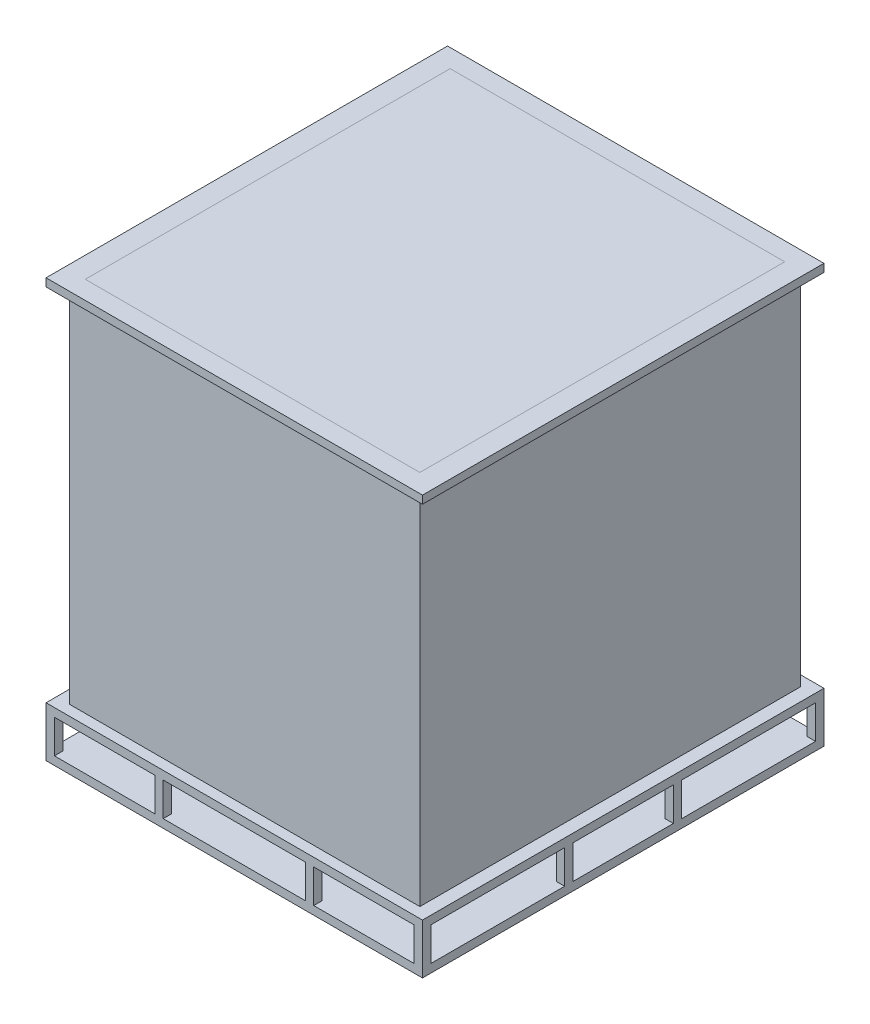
ISO-10303-21;
HEADER;
FILE_DESCRIPTION(('STEP AP214'),'2;1');
FILE_NAME('part.step','',(''),(''),'','','');
FILE_SCHEMA(('AUTOMOTIVE_DESIGN { 1 0 10303 214 1 1 1 1 }'));
ENDSEC;
DATA;
#1=APPLICATION_CONTEXT('core data for automotive mechanical design processes');
#2=APPLICATION_PROTOCOL_DEFINITION('international standard','automotive_design',2000,#1);
#3=PRODUCT_CONTEXT('',#1,'mechanical');
#4=PRODUCT('Part','Part','',(#3));
#5=PRODUCT_RELATED_PRODUCT_CATEGORY('part','',(#4));
#6=PRODUCT_DEFINITION_FORMATION('','',#4);
#7=PRODUCT_DEFINITION_CONTEXT('part definition',#1,'design');
#8=PRODUCT_DEFINITION('design','',#6,#7);
#9=PRODUCT_DEFINITION_SHAPE('','',#8);
#10=(LENGTH_UNIT() NAMED_UNIT(*) SI_UNIT(.MILLI.,.METRE.));
#11=(NAMED_UNIT(*) PLANE_ANGLE_UNIT() SI_UNIT($,.RADIAN.));
#12=(NAMED_UNIT(*) SI_UNIT($,.STERADIAN.) SOLID_ANGLE_UNIT());
#13=UNCERTAINTY_MEASURE_WITH_UNIT(LENGTH_MEASURE(1.E-05),#10,'distance_accuracy_value','');
#14=(GEOMETRIC_REPRESENTATION_CONTEXT(3) GLOBAL_UNCERTAINTY_ASSIGNED_CONTEXT((#13)) GLOBAL_UNIT_ASSIGNED_CONTEXT((#10,
#11,#12)) REPRESENTATION_CONTEXT('',''));
#15=CARTESIAN_POINT('',(0.,0.,0.));
#16=DIRECTION('',(0.,0.,1.));
#17=DIRECTION('',(1.,0.,0.));
#18=AXIS2_PLACEMENT_3D('',#15,#16,#17);
#19=CARTESIAN_POINT('',(0.,0.,0.));
#20=DIRECTION('',(0.,1.,0.));
#21=DIRECTION('',(0.,0.,1.));
#22=AXIS2_PLACEMENT_3D('',#19,#20,#21);
#23=PLANE('',#22);
#24=DIRECTION('',(1.,0.,0.));
#25=VECTOR('',#24,1.);
#26=CARTESIAN_POINT('',(-508.,0.,-554.));
#27=LINE('',#26,#25);
#28=CARTESIAN_POINT('',(-508.,0.,-554.));
#29=VERTEX_POINT('',#28);
#30=CARTESIAN_POINT('',(508.,0.,-554.));
#31=VERTEX_POINT('',#30);
#32=EDGE_CURVE('E96',#29,#31,#27,.T.);
#33=ORIENTED_EDGE('',*,*,#32,.F.);
#34=DIRECTION('',(0.,0.,1.));
#35=VECTOR('',#34,1.);
#36=CARTESIAN_POINT('',(-508.,0.,-554.));
#37=LINE('',#36,#35);
#38=CARTESIAN_POINT('',(-508.,0.,554.));
#39=VERTEX_POINT('',#38);
#40=EDGE_CURVE('E119',#29,#39,#37,.T.);
#41=ORIENTED_EDGE('',*,*,#40,.T.);
#42=DIRECTION('',(1.,0.,0.));
#43=VECTOR('',#42,1.);
#44=CARTESIAN_POINT('',(-508.,0.,554.));
#45=LINE('',#44,#43);
#46=CARTESIAN_POINT('',(508.,0.,554.));
#47=VERTEX_POINT('',#46);
#48=EDGE_CURVE('E124',#39,#47,#45,.T.);
#49=ORIENTED_EDGE('',*,*,#48,.T.);
#50=DIRECTION('',(0.,0.,1.));
#51=VECTOR('',#50,1.);
#52=CARTESIAN_POINT('',(508.,0.,-554.));
#53=LINE('',#52,#51);
#54=EDGE_CURVE('E139',#31,#47,#53,.T.);
#55=ORIENTED_EDGE('',*,*,#54,.F.);
#56=EDGE_LOOP('',(#33,#41,#49,#55));
#57=FACE_BOUND('',#56,.T.);
#58=ADVANCED_FACE('F87',(#57),#23,.T.);
#59=CARTESIAN_POINT('',(0.,-1117.6,0.));
#60=DIRECTION('',(0.,-1.,0.));
#61=DIRECTION('',(0.,0.,-1.));
#62=AXIS2_PLACEMENT_3D('',#59,#60,#61);
#63=PLANE('',#62);
#64=DIRECTION('',(1.,0.,0.));
#65=VECTOR('',#64,1.);
#66=CARTESIAN_POINT('',(-508.,-1117.6,-554.));
#67=LINE('',#66,#65);
#68=CARTESIAN_POINT('',(-508.,-1117.6,-554.));
#69=VERTEX_POINT('',#68);
#70=CARTESIAN_POINT('',(508.,-1117.6,-554.));
#71=VERTEX_POINT('',#70);
#72=EDGE_CURVE('E150',#69,#71,#67,.T.);
#73=ORIENTED_EDGE('',*,*,#72,.T.);
#74=DIRECTION('',(0.,0.,1.));
#75=VECTOR('',#74,1.);
#76=CARTESIAN_POINT('',(508.,-1117.6,-554.));
#77=LINE('',#76,#75);
#78=CARTESIAN_POINT('',(508.,-1117.6,554.));
#79=VERTEX_POINT('',#78);
#80=EDGE_CURVE('E137',#71,#79,#77,.T.);
#81=ORIENTED_EDGE('',*,*,#80,.T.);
#82=DIRECTION('',(1.,0.,0.));
#83=VECTOR('',#82,1.);
#84=CARTESIAN_POINT('',(-508.,-1117.6,554.));
#85=LINE('',#84,#83);
#86=CARTESIAN_POINT('',(-508.,-1117.6,554.));
#87=VERTEX_POINT('',#86);
#88=EDGE_CURVE('E142',#87,#79,#85,.T.);
#89=ORIENTED_EDGE('',*,*,#88,.F.);
#90=DIRECTION('',(0.,0.,1.));
#91=VECTOR('',#90,1.);
#92=CARTESIAN_POINT('',(-508.,-1117.6,-554.));
#93=LINE('',#92,#91);
#94=EDGE_CURVE('E161',#69,#87,#93,.T.);
#95=ORIENTED_EDGE('',*,*,#94,.F.);
#96=EDGE_LOOP('',(#73,#81,#89,#95));
#97=FACE_BOUND('',#96,.T.);
#98=ADVANCED_FACE('F149',(#97),#63,.T.);
#99=CARTESIAN_POINT('',(508.,1503.30302999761,-554.));
#100=DIRECTION('',(1.,0.,0.));
#101=DIRECTION('',(0.,0.,-1.));
#102=AXIS2_PLACEMENT_3D('',#99,#100,#101);
#103=PLANE('',#102);
#104=DIRECTION('',(0.,-1.,0.));
#105=VECTOR('',#104,1.);
#106=CARTESIAN_POINT('',(508.,1503.30302999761,-554.));
#107=LINE('',#106,#105);
#108=EDGE_CURVE('E14',#31,#71,#107,.T.);
#109=ORIENTED_EDGE('',*,*,#108,.F.);
#110=ORIENTED_EDGE('',*,*,#54,.T.);
#111=DIRECTION('',(0.,-1.,0.));
#112=VECTOR('',#111,1.);
#113=CARTESIAN_POINT('',(508.,1503.30302999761,554.));
#114=LINE('',#113,#112);
#115=EDGE_CURVE('E134',#47,#79,#114,.T.);
#116=ORIENTED_EDGE('',*,*,#115,.T.);
#117=ORIENTED_EDGE('',*,*,#80,.F.);
#118=EDGE_LOOP('',(#109,#110,#116,#117));
#119=FACE_BOUND('',#118,.T.);
#120=ADVANCED_FACE('F135',(#119),#103,.T.);
#121=CARTESIAN_POINT('',(-508.,1503.30302999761,554.));
#122=DIRECTION('',(0.,0.,-1.));
#123=DIRECTION('',(-1.,0.,0.));
#124=AXIS2_PLACEMENT_3D('',#121,#122,#123);
#125=PLANE('',#124);
#126=ORIENTED_EDGE('',*,*,#48,.F.);
#127=DIRECTION('',(0.,-1.,0.));
#128=VECTOR('',#127,1.);
#129=CARTESIAN_POINT('',(-508.,1503.30302999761,554.));
#130=LINE('',#129,#128);
#131=EDGE_CURVE('E129',#39,#87,#130,.T.);
#132=ORIENTED_EDGE('',*,*,#131,.T.);
#133=ORIENTED_EDGE('',*,*,#88,.T.);
#134=ORIENTED_EDGE('',*,*,#115,.F.);
#135=EDGE_LOOP('',(#126,#132,#133,#134));
#136=FACE_BOUND('',#135,.T.);
#137=ADVANCED_FACE('F143',(#136),#125,.F.);
#138=CARTESIAN_POINT('',(-508.,1503.30302999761,-554.));
#139=DIRECTION('',(1.,0.,0.));
#140=DIRECTION('',(0.,0.,-1.));
#141=AXIS2_PLACEMENT_3D('',#138,#139,#140);
#142=PLANE('',#141);
#143=ORIENTED_EDGE('',*,*,#40,.F.);
#144=DIRECTION('',(0.,-1.,0.));
#145=VECTOR('',#144,1.);
#146=CARTESIAN_POINT('',(-508.,1503.30302999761,-554.));
#147=LINE('',#146,#145);
#148=EDGE_CURVE('E147',#29,#69,#147,.T.);
#149=ORIENTED_EDGE('',*,*,#148,.T.);
#150=ORIENTED_EDGE('',*,*,#94,.T.);
#151=ORIENTED_EDGE('',*,*,#131,.F.);
#152=EDGE_LOOP('',(#143,#149,#150,#151));
#153=FACE_BOUND('',#152,.T.);
#154=ADVANCED_FACE('F171',(#153),#142,.F.);
#155=CARTESIAN_POINT('',(-508.,1503.30302999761,-554.));
#156=DIRECTION('',(0.,0.,-1.));
#157=DIRECTION('',(-1.,0.,0.));
#158=AXIS2_PLACEMENT_3D('',#155,#156,#157);
#159=PLANE('',#158);
#160=ORIENTED_EDGE('',*,*,#148,.F.);
#161=ORIENTED_EDGE('',*,*,#32,.T.);
#162=ORIENTED_EDGE('',*,*,#108,.T.);
#163=ORIENTED_EDGE('',*,*,#72,.F.);
#164=EDGE_LOOP('',(#160,#161,#162,#163));
#165=FACE_BOUND('',#164,.T.);
#166=ADVANCED_FACE('F173',(#165),#159,.T.);
#167=CLOSED_SHELL('',(#58,#98,#120,#137,#154,#166));
#168=MANIFOLD_SOLID_BREP('B2',#167);
#169=CARTESIAN_POINT('',(571.5,-1143.,584.2));
#170=DIRECTION('',(0.,0.,-1.));
#171=DIRECTION('',(-1.,0.,0.));
#172=AXIS2_PLACEMENT_3D('',#169,#170,#171);
#173=PLANE('',#172);
#174=DIRECTION('',(0.,1.,0.));
#175=VECTOR('',#174,1.);
#176=CARTESIAN_POINT('',(-546.1,-1143.,584.2));
#177=LINE('',#176,#175);
#178=CARTESIAN_POINT('',(-546.1,-1244.6,584.2));
#179=VERTEX_POINT('',#178);
#180=CARTESIAN_POINT('',(-546.1,-1143.,584.2));
#181=VERTEX_POINT('',#180);
#182=EDGE_CURVE('E830',#179,#181,#177,.T.);
#183=ORIENTED_EDGE('',*,*,#182,.F.);
#184=DIRECTION('',(-1.,0.,0.));
#185=VECTOR('',#184,1.);
#186=CARTESIAN_POINT('',(571.5,-1244.6,584.2));
#187=LINE('',#186,#185);
#188=CARTESIAN_POINT('',(-571.5,-1244.6,584.2));
#189=VERTEX_POINT('',#188);
#190=EDGE_CURVE('E995',#179,#189,#187,.T.);
#191=ORIENTED_EDGE('',*,*,#190,.T.);
#192=DIRECTION('',(0.,-1.,0.));
#193=VECTOR('',#192,1.);
#194=CARTESIAN_POINT('',(-571.5,-1143.,584.2));
#195=LINE('',#194,#193);
#196=CARTESIAN_POINT('',(-571.5,-1143.,584.2));
#197=VERTEX_POINT('',#196);
#198=EDGE_CURVE('E891',#197,#189,#195,.T.);
#199=ORIENTED_EDGE('',*,*,#198,.F.);
#200=DIRECTION('',(-1.,0.,0.));
#201=VECTOR('',#200,1.);
#202=CARTESIAN_POINT('',(571.5,-1143.,584.2));
#203=LINE('',#202,#201);
#204=EDGE_CURVE('E981',#181,#197,#203,.T.);
#205=ORIENTED_EDGE('',*,*,#204,.F.);
#206=EDGE_LOOP('',(#183,#191,#199,#205));
#207=FACE_BOUND('',#206,.T.);
#208=ADVANCED_FACE('F222',(#207),#173,.T.);
#209=DIRECTION('',(0.,-1.,0.));
#210=VECTOR('',#209,1.);
#211=CARTESIAN_POINT('',(-241.3,-1143.,584.2));
#212=LINE('',#211,#210);
#213=CARTESIAN_POINT('',(-241.3,-1143.,584.2));
#214=VERTEX_POINT('',#213);
#215=CARTESIAN_POINT('',(-241.3,-1244.6,584.2));
#216=VERTEX_POINT('',#215);
#217=EDGE_CURVE('E808',#214,#216,#212,.T.);
#218=ORIENTED_EDGE('',*,*,#217,.F.);
#219=CARTESIAN_POINT('',(-215.9,-1143.,584.2));
#220=VERTEX_POINT('',#219);
#221=EDGE_CURVE('E1229',#220,#214,#203,.T.);
#222=ORIENTED_EDGE('',*,*,#221,.F.);
#223=DIRECTION('',(0.,1.,0.));
#224=VECTOR('',#223,1.);
#225=CARTESIAN_POINT('',(-215.9,-1143.,584.2));
#226=LINE('',#225,#224);
#227=CARTESIAN_POINT('',(-215.9,-1244.6,584.2));
#228=VERTEX_POINT('',#227);
#229=EDGE_CURVE('E788',#228,#220,#226,.T.);
#230=ORIENTED_EDGE('',*,*,#229,.F.);
#231=EDGE_CURVE('E1329',#228,#216,#187,.T.);
#232=ORIENTED_EDGE('',*,*,#231,.T.);
#233=EDGE_LOOP('',(#218,#222,#230,#232));
#234=FACE_BOUND('',#233,.T.);
#235=ADVANCED_FACE('F1181',(#234),#173,.T.);
#236=DIRECTION('',(0.,-1.,0.));
#237=VECTOR('',#236,1.);
#238=CARTESIAN_POINT('',(215.9,-1143.,584.2));
#239=LINE('',#238,#237);
#240=CARTESIAN_POINT('',(215.9,-1143.,584.2));
#241=VERTEX_POINT('',#240);
#242=CARTESIAN_POINT('',(215.9,-1244.6,584.2));
#243=VERTEX_POINT('',#242);
#244=EDGE_CURVE('E766',#241,#243,#239,.T.);
#245=ORIENTED_EDGE('',*,*,#244,.F.);
#246=CARTESIAN_POINT('',(241.3,-1143.,584.2));
#247=VERTEX_POINT('',#246);
#248=EDGE_CURVE('E986',#247,#241,#203,.T.);
#249=ORIENTED_EDGE('',*,*,#248,.F.);
#250=DIRECTION('',(0.,1.,0.));
#251=VECTOR('',#250,1.);
#252=CARTESIAN_POINT('',(241.3,-1143.,584.2));
#253=LINE('',#252,#251);
#254=CARTESIAN_POINT('',(241.3,-1244.6,584.2));
#255=VERTEX_POINT('',#254);
#256=EDGE_CURVE('E747',#255,#247,#253,.T.);
#257=ORIENTED_EDGE('',*,*,#256,.F.);
#258=EDGE_CURVE('E1001',#255,#243,#187,.T.);
#259=ORIENTED_EDGE('',*,*,#258,.T.);
#260=EDGE_LOOP('',(#245,#249,#257,#259));
#261=FACE_BOUND('',#260,.T.);
#262=ADVANCED_FACE('F1189',(#261),#173,.T.);
#263=CARTESIAN_POINT('',(571.5,-1143.,177.8));
#264=DIRECTION('',(0.,0.,1.));
#265=DIRECTION('',(0.,-1.,0.));
#266=AXIS2_PLACEMENT_3D('',#263,#264,#265);
#267=PLANE('',#266);
#268=DIRECTION('',(0.,-1.,0.));
#269=VECTOR('',#268,1.);
#270=CARTESIAN_POINT('',(-546.1,-1143.,177.8));
#271=LINE('',#270,#269);
#272=CARTESIAN_POINT('',(-546.1,-1143.,177.8));
#273=VERTEX_POINT('',#272);
#274=CARTESIAN_POINT('',(-546.1,-1244.6,177.8));
#275=VERTEX_POINT('',#274);
#276=EDGE_CURVE('E827',#273,#275,#271,.T.);
#277=ORIENTED_EDGE('',*,*,#276,.F.);
#278=DIRECTION('',(-1.,0.,0.));
#279=VECTOR('',#278,1.);
#280=CARTESIAN_POINT('',(571.5,-1143.,177.8));
#281=LINE('',#280,#279);
#282=CARTESIAN_POINT('',(-571.5,-1143.,177.8));
#283=VERTEX_POINT('',#282);
#284=EDGE_CURVE('E985',#273,#283,#281,.T.);
#285=ORIENTED_EDGE('',*,*,#284,.T.);
#286=DIRECTION('',(0.,1.,0.));
#287=VECTOR('',#286,1.);
#288=CARTESIAN_POINT('',(-571.5,-1143.,177.8));
#289=LINE('',#288,#287);
#290=CARTESIAN_POINT('',(-571.5,-1244.6,177.8));
#291=VERTEX_POINT('',#290);
#292=EDGE_CURVE('E897',#291,#283,#289,.T.);
#293=ORIENTED_EDGE('',*,*,#292,.F.);
#294=DIRECTION('',(-1.,0.,0.));
#295=VECTOR('',#294,1.);
#296=CARTESIAN_POINT('',(571.5,-1244.6,177.8));
#297=LINE('',#296,#295);
#298=EDGE_CURVE('E990',#275,#291,#297,.T.);
#299=ORIENTED_EDGE('',*,*,#298,.F.);
#300=EDGE_LOOP('',(#277,#285,#293,#299));
#301=FACE_BOUND('',#300,.T.);
#302=ADVANCED_FACE('F1208',(#301),#267,.T.);
#303=DIRECTION('',(0.,1.,0.));
#304=VECTOR('',#303,1.);
#305=CARTESIAN_POINT('',(-241.3,-1143.,177.8));
#306=LINE('',#305,#304);
#307=CARTESIAN_POINT('',(-241.3,-1244.6,177.8));
#308=VERTEX_POINT('',#307);
#309=CARTESIAN_POINT('',(-241.3,-1143.,177.8));
#310=VERTEX_POINT('',#309);
#311=EDGE_CURVE('E806',#308,#310,#306,.T.);
#312=ORIENTED_EDGE('',*,*,#311,.F.);
#313=CARTESIAN_POINT('',(-215.9,-1244.6,177.8));
#314=VERTEX_POINT('',#313);
#315=EDGE_CURVE('E1464',#314,#308,#297,.T.);
#316=ORIENTED_EDGE('',*,*,#315,.F.);
#317=DIRECTION('',(0.,-1.,0.));
#318=VECTOR('',#317,1.);
#319=CARTESIAN_POINT('',(-215.9,-1143.,177.8));
#320=LINE('',#319,#318);
#321=CARTESIAN_POINT('',(-215.9,-1143.,177.8));
#322=VERTEX_POINT('',#321);
#323=EDGE_CURVE('E785',#322,#314,#320,.T.);
#324=ORIENTED_EDGE('',*,*,#323,.F.);
#325=EDGE_CURVE('E1248',#322,#310,#281,.T.);
#326=ORIENTED_EDGE('',*,*,#325,.T.);
#327=EDGE_LOOP('',(#312,#316,#324,#326));
#328=FACE_BOUND('',#327,.T.);
#329=ADVANCED_FACE('F1213',(#328),#267,.T.);
#330=DIRECTION('',(0.,1.,0.));
#331=VECTOR('',#330,1.);
#332=CARTESIAN_POINT('',(215.9,-1143.,177.8));
#333=LINE('',#332,#331);
#334=CARTESIAN_POINT('',(215.9,-1244.6,177.8));
#335=VERTEX_POINT('',#334);
#336=CARTESIAN_POINT('',(215.9,-1143.,177.8));
#337=VERTEX_POINT('',#336);
#338=EDGE_CURVE('E764',#335,#337,#333,.T.);
#339=ORIENTED_EDGE('',*,*,#338,.F.);
#340=CARTESIAN_POINT('',(241.3,-1244.6,177.8));
#341=VERTEX_POINT('',#340);
#342=EDGE_CURVE('E996',#341,#335,#297,.T.);
#343=ORIENTED_EDGE('',*,*,#342,.F.);
#344=DIRECTION('',(0.,-1.,0.));
#345=VECTOR('',#344,1.);
#346=CARTESIAN_POINT('',(241.3,-1143.,177.8));
#347=LINE('',#346,#345);
#348=CARTESIAN_POINT('',(241.3,-1143.,177.8));
#349=VERTEX_POINT('',#348);
#350=EDGE_CURVE('E744',#349,#341,#347,.T.);
#351=ORIENTED_EDGE('',*,*,#350,.F.);
#352=EDGE_CURVE('E991',#349,#337,#281,.T.);
#353=ORIENTED_EDGE('',*,*,#352,.T.);
#354=EDGE_LOOP('',(#339,#343,#351,#353));
#355=FACE_BOUND('',#354,.T.);
#356=ADVANCED_FACE('F1259',(#355),#267,.T.);
#357=CARTESIAN_POINT('',(571.5,-1143.,-177.8));
#358=DIRECTION('',(0.,0.,-1.));
#359=DIRECTION('',(0.,1.,0.));
#360=AXIS2_PLACEMENT_3D('',#357,#358,#359);
#361=PLANE('',#360);
#362=DIRECTION('',(0.,1.,0.));
#363=VECTOR('',#362,1.);
#364=CARTESIAN_POINT('',(-546.1,-1143.,-177.8));
#365=LINE('',#364,#363);
#366=CARTESIAN_POINT('',(-546.1,-1244.6,-177.8));
#367=VERTEX_POINT('',#366);
#368=CARTESIAN_POINT('',(-546.1,-1143.,-177.8));
#369=VERTEX_POINT('',#368);
#370=EDGE_CURVE('E825',#367,#369,#365,.T.);
#371=ORIENTED_EDGE('',*,*,#370,.F.);
#372=DIRECTION('',(-1.,0.,0.));
#373=VECTOR('',#372,1.);
#374=CARTESIAN_POINT('',(571.5,-1244.6,-177.8));
#375=LINE('',#374,#373);
#376=CARTESIAN_POINT('',(-571.5,-1244.6,-177.8));
#377=VERTEX_POINT('',#376);
#378=EDGE_CURVE('E966',#367,#377,#375,.T.);
#379=ORIENTED_EDGE('',*,*,#378,.T.);
#380=DIRECTION('',(0.,-1.,0.));
#381=VECTOR('',#380,1.);
#382=CARTESIAN_POINT('',(-571.5,-1143.,-177.8));
#383=LINE('',#382,#381);
#384=CARTESIAN_POINT('',(-571.5,-1143.,-177.8));
#385=VERTEX_POINT('',#384);
#386=EDGE_CURVE('E879',#385,#377,#383,.T.);
#387=ORIENTED_EDGE('',*,*,#386,.F.);
#388=DIRECTION('',(-1.,0.,0.));
#389=VECTOR('',#388,1.);
#390=CARTESIAN_POINT('',(571.5,-1143.,-177.8));
#391=LINE('',#390,#389);
#392=EDGE_CURVE('E953',#369,#385,#391,.T.);
#393=ORIENTED_EDGE('',*,*,#392,.F.);
#394=EDGE_LOOP('',(#371,#379,#387,#393));
#395=FACE_BOUND('',#394,.T.);
#396=ADVANCED_FACE('F1416',(#395),#361,.T.);
#397=DIRECTION('',(0.,-1.,0.));
#398=VECTOR('',#397,1.);
#399=CARTESIAN_POINT('',(-241.3,-1143.,-177.8));
#400=LINE('',#399,#398);
#401=CARTESIAN_POINT('',(-241.3,-1143.,-177.8));
#402=VERTEX_POINT('',#401);
#403=CARTESIAN_POINT('',(-241.3,-1244.6,-177.8));
#404=VERTEX_POINT('',#403);
#405=EDGE_CURVE('E803',#402,#404,#400,.T.);
#406=ORIENTED_EDGE('',*,*,#405,.F.);
#407=CARTESIAN_POINT('',(-215.9,-1143.,-177.8));
#408=VERTEX_POINT('',#407);
#409=EDGE_CURVE('E1362',#408,#402,#391,.T.);
#410=ORIENTED_EDGE('',*,*,#409,.F.);
#411=DIRECTION('',(0.,1.,0.));
#412=VECTOR('',#411,1.);
#413=CARTESIAN_POINT('',(-215.9,-1143.,-177.8));
#414=LINE('',#413,#412);
#415=CARTESIAN_POINT('',(-215.9,-1244.6,-177.8));
#416=VERTEX_POINT('',#415);
#417=EDGE_CURVE('E783',#416,#408,#414,.T.);
#418=ORIENTED_EDGE('',*,*,#417,.F.);
#419=EDGE_CURVE('E1451',#416,#404,#375,.T.);
#420=ORIENTED_EDGE('',*,*,#419,.T.);
#421=EDGE_LOOP('',(#406,#410,#418,#420));
#422=FACE_BOUND('',#421,.T.);
#423=ADVANCED_FACE('F1597',(#422),#361,.T.);
#424=DIRECTION('',(0.,-1.,0.));
#425=VECTOR('',#424,1.);
#426=CARTESIAN_POINT('',(215.9,-1143.,-177.8));
#427=LINE('',#426,#425);
#428=CARTESIAN_POINT('',(215.9,-1143.,-177.8));
#429=VERTEX_POINT('',#428);
#430=CARTESIAN_POINT('',(215.9,-1244.6,-177.8));
#431=VERTEX_POINT('',#430);
#432=EDGE_CURVE('E761',#429,#431,#427,.T.);
#433=ORIENTED_EDGE('',*,*,#432,.F.);
#434=CARTESIAN_POINT('',(241.3,-1143.,-177.8));
#435=VERTEX_POINT('',#434);
#436=EDGE_CURVE('E958',#435,#429,#391,.T.);
#437=ORIENTED_EDGE('',*,*,#436,.F.);
#438=DIRECTION('',(0.,1.,0.));
#439=VECTOR('',#438,1.);
#440=CARTESIAN_POINT('',(241.3,-1143.,-177.8));
#441=LINE('',#440,#439);
#442=CARTESIAN_POINT('',(241.3,-1244.6,-177.8));
#443=VERTEX_POINT('',#442);
#444=EDGE_CURVE('E742',#443,#435,#441,.T.);
#445=ORIENTED_EDGE('',*,*,#444,.F.);
#446=EDGE_CURVE('E972',#443,#431,#375,.T.);
#447=ORIENTED_EDGE('',*,*,#446,.T.);
#448=EDGE_LOOP('',(#433,#437,#445,#447));
#449=FACE_BOUND('',#448,.T.);
#450=ADVANCED_FACE('F1599',(#449),#361,.T.);
#451=CARTESIAN_POINT('',(571.5,-1143.,-584.2));
#452=DIRECTION('',(0.,0.,1.));
#453=DIRECTION('',(1.,0.,0.));
#454=AXIS2_PLACEMENT_3D('',#451,#452,#453);
#455=PLANE('',#454);
#456=DIRECTION('',(0.,-1.,0.));
#457=VECTOR('',#456,1.);
#458=CARTESIAN_POINT('',(-546.1,-1143.,-584.2));
#459=LINE('',#458,#457);
#460=CARTESIAN_POINT('',(-546.1,-1143.,-584.2));
#461=VERTEX_POINT('',#460);
#462=CARTESIAN_POINT('',(-546.1,-1244.6,-584.2));
#463=VERTEX_POINT('',#462);
#464=EDGE_CURVE('E822',#461,#463,#459,.T.);
#465=ORIENTED_EDGE('',*,*,#464,.F.);
#466=DIRECTION('',(-1.,0.,0.));
#467=VECTOR('',#466,1.);
#468=CARTESIAN_POINT('',(571.5,-1143.,-584.2));
#469=LINE('',#468,#467);
#470=CARTESIAN_POINT('',(-571.5,-1143.,-584.2));
#471=VERTEX_POINT('',#470);
#472=EDGE_CURVE('E957',#461,#471,#469,.T.);
#473=ORIENTED_EDGE('',*,*,#472,.T.);
#474=DIRECTION('',(0.,1.,0.));
#475=VECTOR('',#474,1.);
#476=CARTESIAN_POINT('',(-571.5,-1143.,-584.2));
#477=LINE('',#476,#475);
#478=CARTESIAN_POINT('',(-571.5,-1244.6,-584.2));
#479=VERTEX_POINT('',#478);
#480=EDGE_CURVE('E885',#479,#471,#477,.T.);
#481=ORIENTED_EDGE('',*,*,#480,.F.);
#482=DIRECTION('',(-1.,0.,0.));
#483=VECTOR('',#482,1.);
#484=CARTESIAN_POINT('',(571.5,-1244.6,-584.2));
#485=LINE('',#484,#483);
#486=EDGE_CURVE('E961',#463,#479,#485,.T.);
#487=ORIENTED_EDGE('',*,*,#486,.F.);
#488=EDGE_LOOP('',(#465,#473,#481,#487));
#489=FACE_BOUND('',#488,.T.);
#490=ADVANCED_FACE('F1422',(#489),#455,.T.);
#491=DIRECTION('',(0.,1.,0.));
#492=VECTOR('',#491,1.);
#493=CARTESIAN_POINT('',(-241.3,-1143.,-584.2));
#494=LINE('',#493,#492);
#495=CARTESIAN_POINT('',(-241.3,-1244.6,-584.2));
#496=VERTEX_POINT('',#495);
#497=CARTESIAN_POINT('',(-241.3,-1143.,-584.2));
#498=VERTEX_POINT('',#497);
#499=EDGE_CURVE('E801',#496,#498,#494,.T.);
#500=ORIENTED_EDGE('',*,*,#499,.F.);
#501=CARTESIAN_POINT('',(-215.9,-1244.6,-584.2));
#502=VERTEX_POINT('',#501);
#503=EDGE_CURVE('E1491',#502,#496,#485,.T.);
#504=ORIENTED_EDGE('',*,*,#503,.F.);
#505=DIRECTION('',(0.,-1.,0.));
#506=VECTOR('',#505,1.);
#507=CARTESIAN_POINT('',(-215.9,-1143.,-584.2));
#508=LINE('',#507,#506);
#509=CARTESIAN_POINT('',(-215.9,-1143.,-584.2));
#510=VERTEX_POINT('',#509);
#511=EDGE_CURVE('E780',#510,#502,#508,.T.);
#512=ORIENTED_EDGE('',*,*,#511,.F.);
#513=EDGE_CURVE('E1424',#510,#498,#469,.T.);
#514=ORIENTED_EDGE('',*,*,#513,.T.);
#515=EDGE_LOOP('',(#500,#504,#512,#514));
#516=FACE_BOUND('',#515,.T.);
#517=ADVANCED_FACE('F1490',(#516),#455,.T.);
#518=DIRECTION('',(0.,1.,0.));
#519=VECTOR('',#518,1.);
#520=CARTESIAN_POINT('',(215.9,-1143.,-584.2));
#521=LINE('',#520,#519);
#522=CARTESIAN_POINT('',(215.9,-1244.6,-584.2));
#523=VERTEX_POINT('',#522);
#524=CARTESIAN_POINT('',(215.9,-1143.,-584.2));
#525=VERTEX_POINT('',#524);
#526=EDGE_CURVE('E759',#523,#525,#521,.T.);
#527=ORIENTED_EDGE('',*,*,#526,.F.);
#528=CARTESIAN_POINT('',(241.3,-1244.6,-584.2));
#529=VERTEX_POINT('',#528);
#530=EDGE_CURVE('E967',#529,#523,#485,.T.);
#531=ORIENTED_EDGE('',*,*,#530,.F.);
#532=DIRECTION('',(0.,-1.,0.));
#533=VECTOR('',#532,1.);
#534=CARTESIAN_POINT('',(241.3,-1143.,-584.2));
#535=LINE('',#534,#533);
#536=CARTESIAN_POINT('',(241.3,-1143.,-584.2));
#537=VERTEX_POINT('',#536);
#538=EDGE_CURVE('E739',#537,#529,#535,.T.);
#539=ORIENTED_EDGE('',*,*,#538,.F.);
#540=EDGE_CURVE('E962',#537,#525,#469,.T.);
#541=ORIENTED_EDGE('',*,*,#540,.T.);
#542=EDGE_LOOP('',(#527,#531,#539,#541));
#543=FACE_BOUND('',#542,.T.);
#544=ADVANCED_FACE('F1432',(#543),#455,.T.);
#545=CARTESIAN_POINT('',(571.5,-1143.,152.4));
#546=DIRECTION('',(0.,0.,-1.));
#547=DIRECTION('',(-1.,0.,0.));
#548=AXIS2_PLACEMENT_3D('',#545,#546,#547);
#549=PLANE('',#548);
#550=DIRECTION('',(0.,1.,0.));
#551=VECTOR('',#550,1.);
#552=CARTESIAN_POINT('',(-546.1,-1143.,152.4));
#553=LINE('',#552,#551);
#554=CARTESIAN_POINT('',(-546.1,-1244.6,152.4));
#555=VERTEX_POINT('',#554);
#556=CARTESIAN_POINT('',(-546.1,-1143.,152.4));
#557=VERTEX_POINT('',#556);
#558=EDGE_CURVE('E820',#555,#557,#553,.T.);
#559=ORIENTED_EDGE('',*,*,#558,.F.);
#560=DIRECTION('',(-1.,0.,0.));
#561=VECTOR('',#560,1.);
#562=CARTESIAN_POINT('',(571.5,-1244.6,152.4));
#563=LINE('',#562,#561);
#564=CARTESIAN_POINT('',(-571.5,-1244.6,152.4));
#565=VERTEX_POINT('',#564);
#566=EDGE_CURVE('E938',#555,#565,#563,.T.);
#567=ORIENTED_EDGE('',*,*,#566,.T.);
#568=DIRECTION('',(0.,-1.,0.));
#569=VECTOR('',#568,1.);
#570=CARTESIAN_POINT('',(-571.5,-1143.,152.4));
#571=LINE('',#570,#569);
#572=CARTESIAN_POINT('',(-571.5,-1143.,152.4));
#573=VERTEX_POINT('',#572);
#574=EDGE_CURVE('E867',#573,#565,#571,.T.);
#575=ORIENTED_EDGE('',*,*,#574,.F.);
#576=DIRECTION('',(-1.,0.,0.));
#577=VECTOR('',#576,1.);
#578=CARTESIAN_POINT('',(571.5,-1143.,152.4));
#579=LINE('',#578,#577);
#580=EDGE_CURVE('E924',#557,#573,#579,.T.);
#581=ORIENTED_EDGE('',*,*,#580,.F.);
#582=EDGE_LOOP('',(#559,#567,#575,#581));
#583=FACE_BOUND('',#582,.T.);
#584=ADVANCED_FACE('F1477',(#583),#549,.T.);
#585=DIRECTION('',(0.,-1.,0.));
#586=VECTOR('',#585,1.);
#587=CARTESIAN_POINT('',(-241.3,-1143.,152.4));
#588=LINE('',#587,#586);
#589=CARTESIAN_POINT('',(-241.3,-1143.,152.4));
#590=VERTEX_POINT('',#589);
#591=CARTESIAN_POINT('',(-241.3,-1244.6,152.4));
#592=VERTEX_POINT('',#591);
#593=EDGE_CURVE('E798',#590,#592,#588,.T.);
#594=ORIENTED_EDGE('',*,*,#593,.F.);
#595=CARTESIAN_POINT('',(-215.9,-1143.,152.4));
#596=VERTEX_POINT('',#595);
#597=EDGE_CURVE('E1465',#596,#590,#579,.T.);
#598=ORIENTED_EDGE('',*,*,#597,.F.);
#599=DIRECTION('',(0.,1.,0.));
#600=VECTOR('',#599,1.);
#601=CARTESIAN_POINT('',(-215.9,-1143.,152.4));
#602=LINE('',#601,#600);
#603=CARTESIAN_POINT('',(-215.9,-1244.6,152.4));
#604=VERTEX_POINT('',#603);
#605=EDGE_CURVE('E778',#604,#596,#602,.T.);
#606=ORIENTED_EDGE('',*,*,#605,.F.);
#607=EDGE_CURVE('E1473',#604,#592,#563,.T.);
#608=ORIENTED_EDGE('',*,*,#607,.T.);
#609=EDGE_LOOP('',(#594,#598,#606,#608));
#610=FACE_BOUND('',#609,.T.);
#611=ADVANCED_FACE('F1471',(#610),#549,.T.);
#612=DIRECTION('',(0.,-1.,0.));
#613=VECTOR('',#612,1.);
#614=CARTESIAN_POINT('',(215.9,-1143.,152.4));
#615=LINE('',#614,#613);
#616=CARTESIAN_POINT('',(215.9,-1143.,152.4));
#617=VERTEX_POINT('',#616);
#618=CARTESIAN_POINT('',(215.9,-1244.6,152.4));
#619=VERTEX_POINT('',#618);
#620=EDGE_CURVE('E756',#617,#619,#615,.T.);
#621=ORIENTED_EDGE('',*,*,#620,.F.);
#622=CARTESIAN_POINT('',(241.3,-1143.,152.4));
#623=VERTEX_POINT('',#622);
#624=EDGE_CURVE('E929',#623,#617,#579,.T.);
#625=ORIENTED_EDGE('',*,*,#624,.F.);
#626=DIRECTION('',(0.,1.,0.));
#627=VECTOR('',#626,1.);
#628=CARTESIAN_POINT('',(241.3,-1143.,152.4));
#629=LINE('',#628,#627);
#630=CARTESIAN_POINT('',(241.3,-1244.6,152.4));
#631=VERTEX_POINT('',#630);
#632=EDGE_CURVE('E737',#631,#623,#629,.T.);
#633=ORIENTED_EDGE('',*,*,#632,.F.);
#634=EDGE_CURVE('E944',#631,#619,#563,.T.);
#635=ORIENTED_EDGE('',*,*,#634,.T.);
#636=EDGE_LOOP('',(#621,#625,#633,#635));
#637=FACE_BOUND('',#636,.T.);
#638=ADVANCED_FACE('F1522',(#637),#549,.T.);
#639=CARTESIAN_POINT('',(571.5,-1143.,-152.4));
#640=DIRECTION('',(0.,0.,1.));
#641=DIRECTION('',(1.,0.,0.));
#642=AXIS2_PLACEMENT_3D('',#639,#640,#641);
#643=PLANE('',#642);
#644=DIRECTION('',(0.,-1.,0.));
#645=VECTOR('',#644,1.);
#646=CARTESIAN_POINT('',(-546.1,-1143.,-152.4));
#647=LINE('',#646,#645);
#648=CARTESIAN_POINT('',(-546.1,-1143.,-152.4));
#649=VERTEX_POINT('',#648);
#650=CARTESIAN_POINT('',(-546.1,-1244.6,-152.4));
#651=VERTEX_POINT('',#650);
#652=EDGE_CURVE('E817',#649,#651,#647,.T.);
#653=ORIENTED_EDGE('',*,*,#652,.F.);
#654=DIRECTION('',(-1.,0.,0.));
#655=VECTOR('',#654,1.);
#656=CARTESIAN_POINT('',(571.5,-1143.,-152.4));
#657=LINE('',#656,#655);
#658=CARTESIAN_POINT('',(-571.5,-1143.,-152.4));
#659=VERTEX_POINT('',#658);
#660=EDGE_CURVE('E928',#649,#659,#657,.T.);
#661=ORIENTED_EDGE('',*,*,#660,.T.);
#662=DIRECTION('',(0.,1.,0.));
#663=VECTOR('',#662,1.);
#664=CARTESIAN_POINT('',(-571.5,-1143.,-152.4));
#665=LINE('',#664,#663);
#666=CARTESIAN_POINT('',(-571.5,-1244.6,-152.4));
#667=VERTEX_POINT('',#666);
#668=EDGE_CURVE('E873',#667,#659,#665,.T.);
#669=ORIENTED_EDGE('',*,*,#668,.F.);
#670=DIRECTION('',(-1.,0.,0.));
#671=VECTOR('',#670,1.);
#672=CARTESIAN_POINT('',(571.5,-1244.6,-152.4));
#673=LINE('',#672,#671);
#674=EDGE_CURVE('E933',#651,#667,#673,.T.);
#675=ORIENTED_EDGE('',*,*,#674,.F.);
#676=EDGE_LOOP('',(#653,#661,#669,#675));
#677=FACE_BOUND('',#676,.T.);
#678=ADVANCED_FACE('F1377',(#677),#643,.T.);
#679=DIRECTION('',(0.,1.,0.));
#680=VECTOR('',#679,1.);
#681=CARTESIAN_POINT('',(-241.3,-1143.,-152.4));
#682=LINE('',#681,#680);
#683=CARTESIAN_POINT('',(-241.3,-1244.6,-152.4));
#684=VERTEX_POINT('',#683);
#685=CARTESIAN_POINT('',(-241.3,-1143.,-152.4));
#686=VERTEX_POINT('',#685);
#687=EDGE_CURVE('E796',#684,#686,#682,.T.);
#688=ORIENTED_EDGE('',*,*,#687,.F.);
#689=CARTESIAN_POINT('',(-215.9,-1244.6,-152.4));
#690=VERTEX_POINT('',#689);
#691=EDGE_CURVE('E1388',#690,#684,#673,.T.);
#692=ORIENTED_EDGE('',*,*,#691,.F.);
#693=DIRECTION('',(0.,-1.,0.));
#694=VECTOR('',#693,1.);
#695=CARTESIAN_POINT('',(-215.9,-1143.,-152.4));
#696=LINE('',#695,#694);
#697=CARTESIAN_POINT('',(-215.9,-1143.,-152.4));
#698=VERTEX_POINT('',#697);
#699=EDGE_CURVE('E775',#698,#690,#696,.T.);
#700=ORIENTED_EDGE('',*,*,#699,.F.);
#701=EDGE_CURVE('E1360',#698,#686,#657,.T.);
#702=ORIENTED_EDGE('',*,*,#701,.T.);
#703=EDGE_LOOP('',(#688,#692,#700,#702));
#704=FACE_BOUND('',#703,.T.);
#705=ADVANCED_FACE('F1368',(#704),#643,.T.);
#706=DIRECTION('',(0.,1.,0.));
#707=VECTOR('',#706,1.);
#708=CARTESIAN_POINT('',(215.9,-1143.,-152.4));
#709=LINE('',#708,#707);
#710=CARTESIAN_POINT('',(215.9,-1244.6,-152.4));
#711=VERTEX_POINT('',#710);
#712=CARTESIAN_POINT('',(215.9,-1143.,-152.4));
#713=VERTEX_POINT('',#712);
#714=EDGE_CURVE('E754',#711,#713,#709,.T.);
#715=ORIENTED_EDGE('',*,*,#714,.F.);
#716=CARTESIAN_POINT('',(241.3,-1244.6,-152.4));
#717=VERTEX_POINT('',#716);
#718=EDGE_CURVE('E939',#717,#711,#673,.T.);
#719=ORIENTED_EDGE('',*,*,#718,.F.);
#720=DIRECTION('',(0.,-1.,0.));
#721=VECTOR('',#720,1.);
#722=CARTESIAN_POINT('',(241.3,-1143.,-152.4));
#723=LINE('',#722,#721);
#724=CARTESIAN_POINT('',(241.3,-1143.,-152.4));
#725=VERTEX_POINT('',#724);
#726=EDGE_CURVE('E728',#725,#717,#723,.T.);
#727=ORIENTED_EDGE('',*,*,#726,.F.);
#728=EDGE_CURVE('E934',#725,#713,#657,.T.);
#729=ORIENTED_EDGE('',*,*,#728,.T.);
#730=EDGE_LOOP('',(#715,#719,#727,#729));
#731=FACE_BOUND('',#730,.T.);
#732=ADVANCED_FACE('F1398',(#731),#643,.T.);
#733=CARTESIAN_POINT('',(-508.,-1117.6,-578.13));
#734=DIRECTION('',(0.,0.,-1.));
#735=DIRECTION('',(-1.,0.,0.));
#736=AXIS2_PLACEMENT_3D('',#733,#734,#735);
#737=PLANE('',#736);
#738=DIRECTION('',(0.,1.,0.));
#739=VECTOR('',#738,1.);
#740=CARTESIAN_POINT('',(532.13,-1117.6,-578.13));
#741=LINE('',#740,#739);
#742=CARTESIAN_POINT('',(532.13,-1117.6,-578.13));
#743=VERTEX_POINT('',#742);
#744=CARTESIAN_POINT('',(532.13,-24.13,-578.13));
#745=VERTEX_POINT('',#744);
#746=EDGE_CURVE('E1033',#743,#745,#741,.T.);
#747=ORIENTED_EDGE('',*,*,#746,.F.);
#748=DIRECTION('',(-1.,0.,0.));
#749=VECTOR('',#748,1.);
#750=CARTESIAN_POINT('',(-508.,-1117.6,-578.13));
#751=LINE('',#750,#749);
#752=CARTESIAN_POINT('',(-532.13,-1117.6,-578.13));
#753=VERTEX_POINT('',#752);
#754=EDGE_CURVE('E1024',#743,#753,#751,.T.);
#755=ORIENTED_EDGE('',*,*,#754,.T.);
#756=DIRECTION('',(0.,1.,0.));
#757=VECTOR('',#756,1.);
#758=CARTESIAN_POINT('',(-532.13,-1117.6,-578.13));
#759=LINE('',#758,#757);
#760=CARTESIAN_POINT('',(-532.13,-24.13,-578.13));
#761=VERTEX_POINT('',#760);
#762=EDGE_CURVE('E1037',#753,#761,#759,.T.);
#763=ORIENTED_EDGE('',*,*,#762,.T.);
#764=DIRECTION('',(-1.,0.,0.));
#765=VECTOR('',#764,1.);
#766=CARTESIAN_POINT('',(0.,-24.13,-578.13));
#767=LINE('',#766,#765);
#768=EDGE_CURVE('E1028',#745,#761,#767,.T.);
#769=ORIENTED_EDGE('',*,*,#768,.F.);
#770=EDGE_LOOP('',(#747,#755,#763,#769));
#771=FACE_BOUND('',#770,.T.);
#772=ADVANCED_FACE('F1778',(#771),#737,.T.);
#773=CARTESIAN_POINT('',(-532.13,-1117.6,-554.));
#774=DIRECTION('',(-1.,0.,0.));
#775=DIRECTION('',(0.,0.,1.));
#776=AXIS2_PLACEMENT_3D('',#773,#774,#775);
#777=PLANE('',#776);
#778=ORIENTED_EDGE('',*,*,#762,.F.);
#779=DIRECTION('',(0.,0.,1.));
#780=VECTOR('',#779,1.);
#781=CARTESIAN_POINT('',(-532.13,-1117.6,-554.));
#782=LINE('',#781,#780);
#783=CARTESIAN_POINT('',(-532.13,-1117.6,578.13));
#784=VERTEX_POINT('',#783);
#785=EDGE_CURVE('E1021',#753,#784,#782,.T.);
#786=ORIENTED_EDGE('',*,*,#785,.T.);
#787=DIRECTION('',(0.,1.,0.));
#788=VECTOR('',#787,1.);
#789=CARTESIAN_POINT('',(-532.13,-1117.6,578.13));
#790=LINE('',#789,#788);
#791=CARTESIAN_POINT('',(-532.13,-24.13,578.13));
#792=VERTEX_POINT('',#791);
#793=EDGE_CURVE('E1040',#784,#792,#790,.T.);
#794=ORIENTED_EDGE('',*,*,#793,.T.);
#795=DIRECTION('',(0.,0.,1.));
#796=VECTOR('',#795,1.);
#797=CARTESIAN_POINT('',(-532.13,-24.13,0.));
#798=LINE('',#797,#796);
#799=EDGE_CURVE('E1036',#761,#792,#798,.T.);
#800=ORIENTED_EDGE('',*,*,#799,.F.);
#801=EDGE_LOOP('',(#778,#786,#794,#800));
#802=FACE_BOUND('',#801,.T.);
#803=ADVANCED_FACE('F1780',(#802),#777,.T.);
#804=CARTESIAN_POINT('',(-508.,-1117.6,578.13));
#805=DIRECTION('',(0.,0.,1.));
#806=DIRECTION('',(1.,0.,0.));
#807=AXIS2_PLACEMENT_3D('',#804,#805,#806);
#808=PLANE('',#807);
#809=ORIENTED_EDGE('',*,*,#793,.F.);
#810=DIRECTION('',(1.,0.,0.));
#811=VECTOR('',#810,1.);
#812=CARTESIAN_POINT('',(-508.,-1117.6,578.13));
#813=LINE('',#812,#811);
#814=CARTESIAN_POINT('',(532.13,-1117.6,578.13));
#815=VERTEX_POINT('',#814);
#816=EDGE_CURVE('E1018',#784,#815,#813,.T.);
#817=ORIENTED_EDGE('',*,*,#816,.T.);
#818=DIRECTION('',(0.,1.,0.));
#819=VECTOR('',#818,1.);
#820=CARTESIAN_POINT('',(532.13,-1117.6,578.13));
#821=LINE('',#820,#819);
#822=CARTESIAN_POINT('',(532.13,-24.13,578.13));
#823=VERTEX_POINT('',#822);
#824=EDGE_CURVE('E1035',#815,#823,#821,.T.);
#825=ORIENTED_EDGE('',*,*,#824,.T.);
#826=DIRECTION('',(1.,0.,0.));
#827=VECTOR('',#826,1.);
#828=CARTESIAN_POINT('',(0.,-24.13,578.13));
#829=LINE('',#828,#827);
#830=EDGE_CURVE('E1043',#792,#823,#829,.T.);
#831=ORIENTED_EDGE('',*,*,#830,.F.);
#832=EDGE_LOOP('',(#809,#817,#825,#831));
#833=FACE_BOUND('',#832,.T.);
#834=ADVANCED_FACE('F1784',(#833),#808,.T.);
#835=CARTESIAN_POINT('',(532.13,-1117.6,-554.));
#836=DIRECTION('',(1.,0.,0.));
#837=DIRECTION('',(0.,0.,-1.));
#838=AXIS2_PLACEMENT_3D('',#835,#836,#837);
#839=PLANE('',#838);
#840=ORIENTED_EDGE('',*,*,#824,.F.);
#841=DIRECTION('',(0.,0.,-1.));
#842=VECTOR('',#841,1.);
#843=CARTESIAN_POINT('',(532.13,-1117.6,-554.));
#844=LINE('',#843,#842);
#845=EDGE_CURVE('E85',#815,#743,#844,.T.);
#846=ORIENTED_EDGE('',*,*,#845,.T.);
#847=ORIENTED_EDGE('',*,*,#746,.T.);
#848=DIRECTION('',(0.,0.,-1.));
#849=VECTOR('',#848,1.);
#850=CARTESIAN_POINT('',(532.13,-24.13,0.));
#851=LINE('',#850,#849);
#852=EDGE_CURVE('E1031',#823,#745,#851,.T.);
#853=ORIENTED_EDGE('',*,*,#852,.F.);
#854=EDGE_LOOP('',(#840,#846,#847,#853));
#855=FACE_BOUND('',#854,.T.);
#856=ADVANCED_FACE('F1788',(#855),#839,.T.);
#857=CARTESIAN_POINT('',(-571.5,0.,-609.6));
#858=DIRECTION('',(-1.,0.,0.));
#859=DIRECTION('',(0.,0.,1.));
#860=AXIS2_PLACEMENT_3D('',#857,#858,#859);
#861=PLANE('',#860);
#862=DIRECTION('',(0.,-1.,0.));
#863=VECTOR('',#862,1.);
#864=CARTESIAN_POINT('',(-571.5,0.,609.6));
#865=LINE('',#864,#863);
#866=CARTESIAN_POINT('',(-571.5,0.,609.6));
#867=VERTEX_POINT('',#866);
#868=CARTESIAN_POINT('',(-571.5,-24.13,609.6));
#869=VERTEX_POINT('',#868);
#870=EDGE_CURVE('E230',#867,#869,#865,.T.);
#871=ORIENTED_EDGE('',*,*,#870,.F.);
#872=DIRECTION('',(0.,0.,1.));
#873=VECTOR('',#872,1.);
#874=CARTESIAN_POINT('',(-571.5,0.,-609.6));
#875=LINE('',#874,#873);
#876=CARTESIAN_POINT('',(-571.5,0.,-609.6));
#877=VERTEX_POINT('',#876);
#878=EDGE_CURVE('E1082',#877,#867,#875,.T.);
#879=ORIENTED_EDGE('',*,*,#878,.F.);
#880=DIRECTION('',(0.,-1.,0.));
#881=VECTOR('',#880,1.);
#882=CARTESIAN_POINT('',(-571.5,0.,-609.6));
#883=LINE('',#882,#881);
#884=CARTESIAN_POINT('',(-571.5,-24.13,-609.6));
#885=VERTEX_POINT('',#884);
#886=EDGE_CURVE('E1132',#877,#885,#883,.T.);
#887=ORIENTED_EDGE('',*,*,#886,.T.);
#888=DIRECTION('',(0.,0.,1.));
#889=VECTOR('',#888,1.);
#890=CARTESIAN_POINT('',(-571.5,-24.13,0.));
#891=LINE('',#890,#889);
#892=EDGE_CURVE('E1057',#885,#869,#891,.T.);
#893=ORIENTED_EDGE('',*,*,#892,.T.);
#894=EDGE_LOOP('',(#871,#879,#887,#893));
#895=FACE_BOUND('',#894,.T.);
#896=ADVANCED_FACE('F1155',(#895),#861,.T.);
#897=CARTESIAN_POINT('',(-571.5,0.,-609.6));
#898=DIRECTION('',(0.,0.,-1.));
#899=DIRECTION('',(-1.,0.,0.));
#900=AXIS2_PLACEMENT_3D('',#897,#898,#899);
#901=PLANE('',#900);
#902=ORIENTED_EDGE('',*,*,#886,.F.);
#903=DIRECTION('',(-1.,0.,0.));
#904=VECTOR('',#903,1.);
#905=CARTESIAN_POINT('',(-571.5,0.,-609.6));
#906=LINE('',#905,#904);
#907=CARTESIAN_POINT('',(571.5,0.,-609.6));
#908=VERTEX_POINT('',#907);
#909=EDGE_CURVE('E1077',#908,#877,#906,.T.);
#910=ORIENTED_EDGE('',*,*,#909,.F.);
#911=DIRECTION('',(0.,-1.,0.));
#912=VECTOR('',#911,1.);
#913=CARTESIAN_POINT('',(571.5,0.,-609.6));
#914=LINE('',#913,#912);
#915=CARTESIAN_POINT('',(571.5,-24.13,-609.6));
#916=VERTEX_POINT('',#915);
#917=EDGE_CURVE('E1130',#908,#916,#914,.T.);
#918=ORIENTED_EDGE('',*,*,#917,.T.);
#919=DIRECTION('',(1.,0.,0.));
#920=VECTOR('',#919,1.);
#921=CARTESIAN_POINT('',(0.,-24.13,-609.6));
#922=LINE('',#921,#920);
#923=EDGE_CURVE('E1053',#916,#885,#922,.F.);
#924=ORIENTED_EDGE('',*,*,#923,.T.);
#925=EDGE_LOOP('',(#902,#910,#918,#924));
#926=FACE_BOUND('',#925,.T.);
#927=ADVANCED_FACE('F1157',(#926),#901,.T.);
#928=CARTESIAN_POINT('',(571.5,0.,-609.6));
#929=DIRECTION('',(1.,0.,0.));
#930=DIRECTION('',(0.,0.,-1.));
#931=AXIS2_PLACEMENT_3D('',#928,#929,#930);
#932=PLANE('',#931);
#933=ORIENTED_EDGE('',*,*,#917,.F.);
#934=DIRECTION('',(0.,0.,-1.));
#935=VECTOR('',#934,1.);
#936=CARTESIAN_POINT('',(571.5,0.,-609.6));
#937=LINE('',#936,#935);
#938=CARTESIAN_POINT('',(571.5,0.,609.6));
#939=VERTEX_POINT('',#938);
#940=EDGE_CURVE('E1027',#939,#908,#937,.T.);
#941=ORIENTED_EDGE('',*,*,#940,.F.);
#942=DIRECTION('',(0.,-1.,0.));
#943=VECTOR('',#942,1.);
#944=CARTESIAN_POINT('',(571.5,0.,609.6));
#945=LINE('',#944,#943);
#946=CARTESIAN_POINT('',(571.5,-24.13,609.6));
#947=VERTEX_POINT('',#946);
#948=EDGE_CURVE('E1039',#939,#947,#945,.T.);
#949=ORIENTED_EDGE('',*,*,#948,.T.);
#950=DIRECTION('',(0.,0.,1.));
#951=VECTOR('',#950,1.);
#952=CARTESIAN_POINT('',(571.5,-24.13,0.));
#953=LINE('',#952,#951);
#954=EDGE_CURVE('E1050',#947,#916,#953,.F.);
#955=ORIENTED_EDGE('',*,*,#954,.T.);
#956=EDGE_LOOP('',(#933,#941,#949,#955));
#957=FACE_BOUND('',#956,.T.);
#958=ADVANCED_FACE('F1145',(#957),#932,.T.);
#959=CARTESIAN_POINT('',(-571.5,0.,609.6));
#960=DIRECTION('',(0.,0.,1.));
#961=DIRECTION('',(1.,0.,0.));
#962=AXIS2_PLACEMENT_3D('',#959,#960,#961);
#963=PLANE('',#962);
#964=DIRECTION('',(1.,0.,0.));
#965=VECTOR('',#964,1.);
#966=CARTESIAN_POINT('',(-571.5,0.,609.6));
#967=LINE('',#966,#965);
#968=EDGE_CURVE('E1087',#867,#939,#967,.T.);
#969=ORIENTED_EDGE('',*,*,#968,.F.);
#970=ORIENTED_EDGE('',*,*,#870,.T.);
#971=DIRECTION('',(1.,0.,0.));
#972=VECTOR('',#971,1.);
#973=CARTESIAN_POINT('',(0.,-24.13,609.6));
#974=LINE('',#973,#972);
#975=EDGE_CURVE('E1032',#869,#947,#974,.T.);
#976=ORIENTED_EDGE('',*,*,#975,.T.);
#977=ORIENTED_EDGE('',*,*,#948,.F.);
#978=EDGE_LOOP('',(#969,#970,#976,#977));
#979=FACE_BOUND('',#978,.T.);
#980=ADVANCED_FACE('F224',(#979),#963,.T.);
#981=CARTESIAN_POINT('',(0.,-24.13,0.));
#982=DIRECTION('',(0.,1.,0.));
#983=DIRECTION('',(0.,0.,1.));
#984=AXIS2_PLACEMENT_3D('',#981,#982,#983);
#985=PLANE('',#984);
#986=ORIENTED_EDGE('',*,*,#768,.T.);
#987=ORIENTED_EDGE('',*,*,#799,.T.);
#988=ORIENTED_EDGE('',*,*,#830,.T.);
#989=ORIENTED_EDGE('',*,*,#852,.T.);
#990=EDGE_LOOP('',(#986,#987,#988,#989));
#991=FACE_BOUND('',#990,.T.);
#992=ORIENTED_EDGE('',*,*,#954,.F.);
#993=ORIENTED_EDGE('',*,*,#975,.F.);
#994=ORIENTED_EDGE('',*,*,#892,.F.);
#995=ORIENTED_EDGE('',*,*,#923,.F.);
#996=EDGE_LOOP('',(#992,#993,#994,#995));
#997=FACE_BOUND('',#996,.T.);
#998=ADVANCED_FACE('F1151',(#991,#997),#985,.F.);
#999=CARTESIAN_POINT('',(-508.,-1117.6,-554.));
#1000=DIRECTION('',(0.,0.,-1.));
#1001=DIRECTION('',(-1.,0.,0.));
#1002=AXIS2_PLACEMENT_3D('',#999,#1000,#1001);
#1003=PLANE('',#1002);
#1004=DIRECTION('',(-1.,0.,0.));
#1005=VECTOR('',#1004,1.);
#1006=CARTESIAN_POINT('',(-508.,0.,-554.));
#1007=LINE('',#1006,#1005);
#1008=CARTESIAN_POINT('',(508.,0.,-554.));
#1009=VERTEX_POINT('',#1008);
#1010=CARTESIAN_POINT('',(-508.,0.,-554.));
#1011=VERTEX_POINT('',#1010);
#1012=EDGE_CURVE('E1092',#1009,#1011,#1007,.T.);
#1013=ORIENTED_EDGE('',*,*,#1012,.T.);
#1014=DIRECTION('',(0.,1.,0.));
#1015=VECTOR('',#1014,1.);
#1016=CARTESIAN_POINT('',(-508.,-1117.6,-554.));
#1017=LINE('',#1016,#1015);
#1018=CARTESIAN_POINT('',(-508.,-1117.6,-554.));
#1019=VERTEX_POINT('',#1018);
#1020=EDGE_CURVE('E1054',#1019,#1011,#1017,.T.);
#1021=ORIENTED_EDGE('',*,*,#1020,.F.);
#1022=DIRECTION('',(-1.,0.,0.));
#1023=VECTOR('',#1022,1.);
#1024=CARTESIAN_POINT('',(-508.,-1117.6,-554.));
#1025=LINE('',#1024,#1023);
#1026=CARTESIAN_POINT('',(508.,-1117.6,-554.));
#1027=VERTEX_POINT('',#1026);
#1028=EDGE_CURVE('E1071',#1027,#1019,#1025,.T.);
#1029=ORIENTED_EDGE('',*,*,#1028,.F.);
#1030=DIRECTION('',(0.,1.,0.));
#1031=VECTOR('',#1030,1.);
#1032=CARTESIAN_POINT('',(508.,-1117.6,-554.));
#1033=LINE('',#1032,#1031);
#1034=EDGE_CURVE('E1065',#1027,#1009,#1033,.T.);
#1035=ORIENTED_EDGE('',*,*,#1034,.T.);
#1036=EDGE_LOOP('',(#1013,#1021,#1029,#1035));
#1037=FACE_BOUND('',#1036,.T.);
#1038=ADVANCED_FACE('F1794',(#1037),#1003,.F.);
#1039=CARTESIAN_POINT('',(-508.,-1117.6,-554.));
#1040=DIRECTION('',(-1.,0.,0.));
#1041=DIRECTION('',(0.,0.,1.));
#1042=AXIS2_PLACEMENT_3D('',#1039,#1040,#1041);
#1043=PLANE('',#1042);
#1044=DIRECTION('',(0.,0.,1.));
#1045=VECTOR('',#1044,1.);
#1046=CARTESIAN_POINT('',(-508.,0.,-554.));
#1047=LINE('',#1046,#1045);
#1048=CARTESIAN_POINT('',(-508.,0.,554.));
#1049=VERTEX_POINT('',#1048);
#1050=EDGE_CURVE('E1074',#1011,#1049,#1047,.T.);
#1051=ORIENTED_EDGE('',*,*,#1050,.T.);
#1052=DIRECTION('',(0.,1.,0.));
#1053=VECTOR('',#1052,1.);
#1054=CARTESIAN_POINT('',(-508.,-1117.6,554.));
#1055=LINE('',#1054,#1053);
#1056=CARTESIAN_POINT('',(-508.,-1117.6,554.));
#1057=VERTEX_POINT('',#1056);
#1058=EDGE_CURVE('E1107',#1057,#1049,#1055,.T.);
#1059=ORIENTED_EDGE('',*,*,#1058,.F.);
#1060=DIRECTION('',(0.,0.,1.));
#1061=VECTOR('',#1060,1.);
#1062=CARTESIAN_POINT('',(-508.,-1117.6,-554.));
#1063=LINE('',#1062,#1061);
#1064=EDGE_CURVE('E1062',#1019,#1057,#1063,.T.);
#1065=ORIENTED_EDGE('',*,*,#1064,.F.);
#1066=ORIENTED_EDGE('',*,*,#1020,.T.);
#1067=EDGE_LOOP('',(#1051,#1059,#1065,#1066));
#1068=FACE_BOUND('',#1067,.T.);
#1069=ADVANCED_FACE('F1797',(#1068),#1043,.F.);
#1070=CARTESIAN_POINT('',(-508.,-1117.6,554.));
#1071=DIRECTION('',(0.,0.,1.));
#1072=DIRECTION('',(1.,0.,0.));
#1073=AXIS2_PLACEMENT_3D('',#1070,#1071,#1072);
#1074=PLANE('',#1073);
#1075=DIRECTION('',(1.,0.,0.));
#1076=VECTOR('',#1075,1.);
#1077=CARTESIAN_POINT('',(-508.,0.,554.));
#1078=LINE('',#1077,#1076);
#1079=CARTESIAN_POINT('',(508.,0.,554.));
#1080=VERTEX_POINT('',#1079);
#1081=EDGE_CURVE('E1097',#1049,#1080,#1078,.T.);
#1082=ORIENTED_EDGE('',*,*,#1081,.T.);
#1083=DIRECTION('',(0.,1.,0.));
#1084=VECTOR('',#1083,1.);
#1085=CARTESIAN_POINT('',(508.,-1117.6,554.));
#1086=LINE('',#1085,#1084);
#1087=CARTESIAN_POINT('',(508.,-1117.6,554.));
#1088=VERTEX_POINT('',#1087);
#1089=EDGE_CURVE('E1116',#1088,#1080,#1086,.T.);
#1090=ORIENTED_EDGE('',*,*,#1089,.F.);
#1091=DIRECTION('',(1.,0.,0.));
#1092=VECTOR('',#1091,1.);
#1093=CARTESIAN_POINT('',(-508.,-1117.6,554.));
#1094=LINE('',#1093,#1092);
#1095=EDGE_CURVE('E1066',#1057,#1088,#1094,.T.);
#1096=ORIENTED_EDGE('',*,*,#1095,.F.);
#1097=ORIENTED_EDGE('',*,*,#1058,.T.);
#1098=EDGE_LOOP('',(#1082,#1090,#1096,#1097));
#1099=FACE_BOUND('',#1098,.T.);
#1100=ADVANCED_FACE('F1800',(#1099),#1074,.F.);
#1101=CARTESIAN_POINT('',(508.,-1117.6,-554.));
#1102=DIRECTION('',(1.,0.,0.));
#1103=DIRECTION('',(0.,0.,-1.));
#1104=AXIS2_PLACEMENT_3D('',#1101,#1102,#1103);
#1105=PLANE('',#1104);
#1106=DIRECTION('',(0.,0.,-1.));
#1107=VECTOR('',#1106,1.);
#1108=CARTESIAN_POINT('',(508.,0.,-554.));
#1109=LINE('',#1108,#1107);
#1110=EDGE_CURVE('E1102',#1080,#1009,#1109,.T.);
#1111=ORIENTED_EDGE('',*,*,#1110,.T.);
#1112=ORIENTED_EDGE('',*,*,#1034,.F.);
#1113=DIRECTION('',(0.,0.,-1.));
#1114=VECTOR('',#1113,1.);
#1115=CARTESIAN_POINT('',(508.,-1117.6,-554.));
#1116=LINE('',#1115,#1114);
#1117=EDGE_CURVE('E1069',#1088,#1027,#1116,.T.);
#1118=ORIENTED_EDGE('',*,*,#1117,.F.);
#1119=ORIENTED_EDGE('',*,*,#1089,.T.);
#1120=EDGE_LOOP('',(#1111,#1112,#1118,#1119));
#1121=FACE_BOUND('',#1120,.T.);
#1122=ADVANCED_FACE('F1174',(#1121),#1105,.F.);
#1123=CARTESIAN_POINT('',(0.,-1117.6,0.));
#1124=DIRECTION('',(0.,-1.,0.));
#1125=DIRECTION('',(0.,0.,-1.));
#1126=AXIS2_PLACEMENT_3D('',#1123,#1124,#1125);
#1127=PLANE('',#1126);
#1128=ORIENTED_EDGE('',*,*,#1028,.T.);
#1129=ORIENTED_EDGE('',*,*,#1064,.T.);
#1130=ORIENTED_EDGE('',*,*,#1095,.T.);
#1131=ORIENTED_EDGE('',*,*,#1117,.T.);
#1132=EDGE_LOOP('',(#1128,#1129,#1130,#1131));
#1133=FACE_BOUND('',#1132,.T.);
#1134=ADVANCED_FACE('F1163',(#1133),#1127,.F.);
#1135=CARTESIAN_POINT('',(0.,0.,0.));
#1136=DIRECTION('',(0.,1.,0.));
#1137=DIRECTION('',(0.,0.,1.));
#1138=AXIS2_PLACEMENT_3D('',#1135,#1136,#1137);
#1139=PLANE('',#1138);
#1140=ORIENTED_EDGE('',*,*,#1012,.F.);
#1141=ORIENTED_EDGE('',*,*,#1110,.F.);
#1142=ORIENTED_EDGE('',*,*,#1081,.F.);
#1143=ORIENTED_EDGE('',*,*,#1050,.F.);
#1144=EDGE_LOOP('',(#1140,#1141,#1142,#1143));
#1145=FACE_BOUND('',#1144,.T.);
#1146=ORIENTED_EDGE('',*,*,#940,.T.);
#1147=ORIENTED_EDGE('',*,*,#909,.T.);
#1148=ORIENTED_EDGE('',*,*,#878,.T.);
#1149=ORIENTED_EDGE('',*,*,#968,.T.);
#1150=EDGE_LOOP('',(#1146,#1147,#1148,#1149));
#1151=FACE_BOUND('',#1150,.T.);
#1152=ADVANCED_FACE('F1160',(#1145,#1151),#1139,.T.);
#1153=CARTESIAN_POINT('',(571.5,0.,0.));
#1154=DIRECTION('',(-1.,0.,0.));
#1155=DIRECTION('',(0.,0.,1.));
#1156=AXIS2_PLACEMENT_3D('',#1153,#1154,#1155);
#1157=PLANE('',#1156);
#1158=DIRECTION('',(0.,-1.,0.));
#1159=VECTOR('',#1158,1.);
#1160=CARTESIAN_POINT('',(571.5,-1143.,-177.8));
#1161=LINE('',#1160,#1159);
#1162=CARTESIAN_POINT('',(571.5,-1143.,-177.8));
#1163=VERTEX_POINT('',#1162);
#1164=CARTESIAN_POINT('',(571.5,-1244.6,-177.8));
#1165=VERTEX_POINT('',#1164);
#1166=EDGE_CURVE('E943',#1163,#1165,#1161,.T.);
#1167=ORIENTED_EDGE('',*,*,#1166,.F.);
#1168=DIRECTION('',(0.,0.,1.));
#1169=VECTOR('',#1168,1.);
#1170=CARTESIAN_POINT('',(571.5,-1143.,-177.8));
#1171=LINE('',#1170,#1169);
#1172=CARTESIAN_POINT('',(571.5,-1143.,-584.2));
#1173=VERTEX_POINT('',#1172);
#1174=EDGE_CURVE('E951',#1173,#1163,#1171,.T.);
#1175=ORIENTED_EDGE('',*,*,#1174,.F.);
#1176=DIRECTION('',(0.,1.,0.));
#1177=VECTOR('',#1176,1.);
#1178=CARTESIAN_POINT('',(571.5,-1143.,-584.2));
#1179=LINE('',#1178,#1177);
#1180=CARTESIAN_POINT('',(571.5,-1244.6,-584.2));
#1181=VERTEX_POINT('',#1180);
#1182=EDGE_CURVE('E948',#1181,#1173,#1179,.T.);
#1183=ORIENTED_EDGE('',*,*,#1182,.F.);
#1184=DIRECTION('',(0.,0.,-1.));
#1185=VECTOR('',#1184,1.);
#1186=CARTESIAN_POINT('',(571.5,-1244.6,-177.8));
#1187=LINE('',#1186,#1185);
#1188=EDGE_CURVE('E946',#1165,#1181,#1187,.T.);
#1189=ORIENTED_EDGE('',*,*,#1188,.F.);
#1190=EDGE_LOOP('',(#1167,#1175,#1183,#1189));
#1191=FACE_BOUND('',#1190,.T.);
#1192=DIRECTION('',(0.,-1.,0.));
#1193=VECTOR('',#1192,1.);
#1194=CARTESIAN_POINT('',(571.5,-1270.,609.6));
#1195=LINE('',#1194,#1193);
#1196=CARTESIAN_POINT('',(571.5,-1117.6,609.6));
#1197=VERTEX_POINT('',#1196);
#1198=CARTESIAN_POINT('',(571.5,-1270.,609.6));
#1199=VERTEX_POINT('',#1198);
#1200=EDGE_CURVE('E1000',#1197,#1199,#1195,.T.);
#1201=ORIENTED_EDGE('',*,*,#1200,.T.);
#1202=DIRECTION('',(0.,0.,-1.));
#1203=VECTOR('',#1202,1.);
#1204=CARTESIAN_POINT('',(571.5,-1270.,609.6));
#1205=LINE('',#1204,#1203);
#1206=CARTESIAN_POINT('',(571.5,-1270.,-609.6));
#1207=VERTEX_POINT('',#1206);
#1208=EDGE_CURVE('E1004',#1199,#1207,#1205,.T.);
#1209=ORIENTED_EDGE('',*,*,#1208,.T.);
#1210=DIRECTION('',(0.,1.,0.));
#1211=VECTOR('',#1210,1.);
#1212=CARTESIAN_POINT('',(571.5,-1270.,-609.6));
#1213=LINE('',#1212,#1211);
#1214=CARTESIAN_POINT('',(571.5,-1117.6,-609.6));
#1215=VERTEX_POINT('',#1214);
#1216=EDGE_CURVE('E1006',#1207,#1215,#1213,.T.);
#1217=ORIENTED_EDGE('',*,*,#1216,.T.);
#1218=DIRECTION('',(0.,0.,1.));
#1219=VECTOR('',#1218,1.);
#1220=CARTESIAN_POINT('',(571.5,-1117.6,609.6));
#1221=LINE('',#1220,#1219);
#1222=EDGE_CURVE('E1008',#1215,#1197,#1221,.T.);
#1223=ORIENTED_EDGE('',*,*,#1222,.T.);
#1224=EDGE_LOOP('',(#1201,#1209,#1217,#1223));
#1225=FACE_BOUND('',#1224,.T.);
#1226=DIRECTION('',(0.,-1.,0.));
#1227=VECTOR('',#1226,1.);
#1228=CARTESIAN_POINT('',(571.5,-1143.,584.2));
#1229=LINE('',#1228,#1227);
#1230=CARTESIAN_POINT('',(571.5,-1143.,584.2));
#1231=VERTEX_POINT('',#1230);
#1232=CARTESIAN_POINT('',(571.5,-1244.6,584.2));
#1233=VERTEX_POINT('',#1232);
#1234=EDGE_CURVE('E971',#1231,#1233,#1229,.T.);
#1235=ORIENTED_EDGE('',*,*,#1234,.F.);
#1236=DIRECTION('',(0.,0.,1.));
#1237=VECTOR('',#1236,1.);
#1238=CARTESIAN_POINT('',(571.5,-1143.,584.2));
#1239=LINE('',#1238,#1237);
#1240=CARTESIAN_POINT('',(571.5,-1143.,177.8));
#1241=VERTEX_POINT('',#1240);
#1242=EDGE_CURVE('E979',#1241,#1231,#1239,.T.);
#1243=ORIENTED_EDGE('',*,*,#1242,.F.);
#1244=DIRECTION('',(0.,1.,0.));
#1245=VECTOR('',#1244,1.);
#1246=CARTESIAN_POINT('',(571.5,-1143.,177.8));
#1247=LINE('',#1246,#1245);
#1248=CARTESIAN_POINT('',(571.5,-1244.6,177.8));
#1249=VERTEX_POINT('',#1248);
#1250=EDGE_CURVE('E976',#1249,#1241,#1247,.T.);
#1251=ORIENTED_EDGE('',*,*,#1250,.F.);
#1252=DIRECTION('',(0.,0.,-1.));
#1253=VECTOR('',#1252,1.);
#1254=CARTESIAN_POINT('',(571.5,-1244.6,584.2));
#1255=LINE('',#1254,#1253);
#1256=EDGE_CURVE('E974',#1233,#1249,#1255,.T.);
#1257=ORIENTED_EDGE('',*,*,#1256,.F.);
#1258=EDGE_LOOP('',(#1235,#1243,#1251,#1257));
#1259=FACE_BOUND('',#1258,.T.);
#1260=DIRECTION('',(0.,-1.,0.));
#1261=VECTOR('',#1260,1.);
#1262=CARTESIAN_POINT('',(571.5,-1143.,152.4));
#1263=LINE('',#1262,#1261);
#1264=CARTESIAN_POINT('',(571.5,-1143.,152.4));
#1265=VERTEX_POINT('',#1264);
#1266=CARTESIAN_POINT('',(571.5,-1244.6,152.4));
#1267=VERTEX_POINT('',#1266);
#1268=EDGE_CURVE('E915',#1265,#1267,#1263,.T.);
#1269=ORIENTED_EDGE('',*,*,#1268,.F.);
#1270=DIRECTION('',(0.,0.,1.));
#1271=VECTOR('',#1270,1.);
#1272=CARTESIAN_POINT('',(571.5,-1143.,152.4));
#1273=LINE('',#1272,#1271);
#1274=CARTESIAN_POINT('',(571.5,-1143.,-152.4));
#1275=VERTEX_POINT('',#1274);
#1276=EDGE_CURVE('E922',#1275,#1265,#1273,.T.);
#1277=ORIENTED_EDGE('',*,*,#1276,.F.);
#1278=DIRECTION('',(0.,1.,0.));
#1279=VECTOR('',#1278,1.);
#1280=CARTESIAN_POINT('',(571.5,-1143.,-152.4));
#1281=LINE('',#1280,#1279);
#1282=CARTESIAN_POINT('',(571.5,-1244.6,-152.4));
#1283=VERTEX_POINT('',#1282);
#1284=EDGE_CURVE('E919',#1283,#1275,#1281,.T.);
#1285=ORIENTED_EDGE('',*,*,#1284,.F.);
#1286=DIRECTION('',(0.,0.,-1.));
#1287=VECTOR('',#1286,1.);
#1288=CARTESIAN_POINT('',(571.5,-1244.6,152.4));
#1289=LINE('',#1288,#1287);
#1290=EDGE_CURVE('E917',#1267,#1283,#1289,.T.);
#1291=ORIENTED_EDGE('',*,*,#1290,.F.);
#1292=EDGE_LOOP('',(#1269,#1277,#1285,#1291));
#1293=FACE_BOUND('',#1292,.T.);
#1294=ADVANCED_FACE('F1162',(#1191,#1225,#1259,#1293),#1157,.F.);
#1295=CARTESIAN_POINT('',(571.5,-1270.,609.6));
#1296=DIRECTION('',(0.,0.,-1.));
#1297=DIRECTION('',(-1.,0.,0.));
#1298=AXIS2_PLACEMENT_3D('',#1295,#1296,#1297);
#1299=PLANE('',#1298);
#1300=DIRECTION('',(-1.,0.,0.));
#1301=VECTOR('',#1300,1.);
#1302=CARTESIAN_POINT('',(571.5,-1244.6,609.6));
#1303=LINE('',#1302,#1301);
#1304=CARTESIAN_POINT('',(-241.3,-1244.6,609.6));
#1305=VERTEX_POINT('',#1304);
#1306=CARTESIAN_POINT('',(-546.1,-1244.6,609.6));
#1307=VERTEX_POINT('',#1306);
#1308=EDGE_CURVE('E858',#1305,#1307,#1303,.T.);
#1309=ORIENTED_EDGE('',*,*,#1308,.T.);
#1310=DIRECTION('',(0.,1.,0.));
#1311=VECTOR('',#1310,1.);
#1312=CARTESIAN_POINT('',(-546.1,-1270.,609.6));
#1313=LINE('',#1312,#1311);
#1314=CARTESIAN_POINT('',(-546.1,-1143.,609.6));
#1315=VERTEX_POINT('',#1314);
#1316=EDGE_CURVE('E835',#1307,#1315,#1313,.T.);
#1317=ORIENTED_EDGE('',*,*,#1316,.T.);
#1318=DIRECTION('',(1.,0.,0.));
#1319=VECTOR('',#1318,1.);
#1320=CARTESIAN_POINT('',(571.5,-1143.,609.6));
#1321=LINE('',#1320,#1319);
#1322=CARTESIAN_POINT('',(-241.3,-1143.,609.6));
#1323=VERTEX_POINT('',#1322);
#1324=EDGE_CURVE('E864',#1315,#1323,#1321,.T.);
#1325=ORIENTED_EDGE('',*,*,#1324,.T.);
#1326=DIRECTION('',(0.,-1.,0.));
#1327=VECTOR('',#1326,1.);
#1328=CARTESIAN_POINT('',(-241.3,-1270.,609.6));
#1329=LINE('',#1328,#1327);
#1330=EDGE_CURVE('E814',#1323,#1305,#1329,.T.);
#1331=ORIENTED_EDGE('',*,*,#1330,.T.);
#1332=EDGE_LOOP('',(#1309,#1317,#1325,#1331));
#1333=FACE_BOUND('',#1332,.T.);
#1334=DIRECTION('',(-1.,0.,0.));
#1335=VECTOR('',#1334,1.);
#1336=CARTESIAN_POINT('',(571.5,-1244.6,609.6));
#1337=LINE('',#1336,#1335);
#1338=CARTESIAN_POINT('',(215.9,-1244.6,609.6));
#1339=VERTEX_POINT('',#1338);
#1340=CARTESIAN_POINT('',(-215.9,-1244.6,609.6));
#1341=VERTEX_POINT('',#1340);
#1342=EDGE_CURVE('E846',#1339,#1341,#1337,.T.);
#1343=ORIENTED_EDGE('',*,*,#1342,.T.);
#1344=DIRECTION('',(0.,1.,0.));
#1345=VECTOR('',#1344,1.);
#1346=CARTESIAN_POINT('',(-215.9,-1270.,609.6));
#1347=LINE('',#1346,#1345);
#1348=CARTESIAN_POINT('',(-215.9,-1143.,609.6));
#1349=VERTEX_POINT('',#1348);
#1350=EDGE_CURVE('E793',#1341,#1349,#1347,.T.);
#1351=ORIENTED_EDGE('',*,*,#1350,.T.);
#1352=DIRECTION('',(1.,0.,0.));
#1353=VECTOR('',#1352,1.);
#1354=CARTESIAN_POINT('',(571.5,-1143.,609.6));
#1355=LINE('',#1354,#1353);
#1356=CARTESIAN_POINT('',(215.9,-1143.,609.6));
#1357=VERTEX_POINT('',#1356);
#1358=EDGE_CURVE('E852',#1349,#1357,#1355,.T.);
#1359=ORIENTED_EDGE('',*,*,#1358,.T.);
#1360=DIRECTION('',(0.,-1.,0.));
#1361=VECTOR('',#1360,1.);
#1362=CARTESIAN_POINT('',(215.9,-1270.,609.6));
#1363=LINE('',#1362,#1361);
#1364=EDGE_CURVE('E772',#1357,#1339,#1363,.T.);
#1365=ORIENTED_EDGE('',*,*,#1364,.T.);
#1366=EDGE_LOOP('',(#1343,#1351,#1359,#1365));
#1367=FACE_BOUND('',#1366,.T.);
#1368=DIRECTION('',(-1.,0.,0.));
#1369=VECTOR('',#1368,1.);
#1370=CARTESIAN_POINT('',(571.5,-1244.6,609.6));
#1371=LINE('',#1370,#1369);
#1372=CARTESIAN_POINT('',(546.1,-1244.6,609.6));
#1373=VERTEX_POINT('',#1372);
#1374=CARTESIAN_POINT('',(241.3,-1244.6,609.6));
#1375=VERTEX_POINT('',#1374);
#1376=EDGE_CURVE('E708',#1373,#1375,#1371,.T.);
#1377=ORIENTED_EDGE('',*,*,#1376,.T.);
#1378=DIRECTION('',(0.,1.,0.));
#1379=VECTOR('',#1378,1.);
#1380=CARTESIAN_POINT('',(241.3,-1270.,609.6));
#1381=LINE('',#1380,#1379);
#1382=CARTESIAN_POINT('',(241.3,-1143.,609.6));
#1383=VERTEX_POINT('',#1382);
#1384=EDGE_CURVE('E751',#1375,#1383,#1381,.T.);
#1385=ORIENTED_EDGE('',*,*,#1384,.T.);
#1386=DIRECTION('',(1.,0.,0.));
#1387=VECTOR('',#1386,1.);
#1388=CARTESIAN_POINT('',(571.5,-1143.,609.6));
#1389=LINE('',#1388,#1387);
#1390=CARTESIAN_POINT('',(546.1,-1143.,609.6));
#1391=VERTEX_POINT('',#1390);
#1392=EDGE_CURVE('E707',#1383,#1391,#1389,.T.);
#1393=ORIENTED_EDGE('',*,*,#1392,.T.);
#1394=DIRECTION('',(0.,-1.,0.));
#1395=VECTOR('',#1394,1.);
#1396=CARTESIAN_POINT('',(546.1,-1270.,609.6));
#1397=LINE('',#1396,#1395);
#1398=EDGE_CURVE('E724',#1391,#1373,#1397,.T.);
#1399=ORIENTED_EDGE('',*,*,#1398,.T.);
#1400=EDGE_LOOP('',(#1377,#1385,#1393,#1399));
#1401=FACE_BOUND('',#1400,.T.);
#1402=DIRECTION('',(-1.,0.,0.));
#1403=VECTOR('',#1402,1.);
#1404=CARTESIAN_POINT('',(571.5,-1117.6,609.6));
#1405=LINE('',#1404,#1403);
#1406=CARTESIAN_POINT('',(-571.5,-1117.6,609.6));
#1407=VERTEX_POINT('',#1406);
#1408=EDGE_CURVE('E1010',#1197,#1407,#1405,.T.);
#1409=ORIENTED_EDGE('',*,*,#1408,.T.);
#1410=DIRECTION('',(0.,-1.,0.));
#1411=VECTOR('',#1410,1.);
#1412=CARTESIAN_POINT('',(-571.5,-1270.,609.6));
#1413=LINE('',#1412,#1411);
#1414=CARTESIAN_POINT('',(-571.5,-1270.,609.6));
#1415=VERTEX_POINT('',#1414);
#1416=EDGE_CURVE('E903',#1407,#1415,#1413,.T.);
#1417=ORIENTED_EDGE('',*,*,#1416,.T.);
#1418=DIRECTION('',(-1.,0.,0.));
#1419=VECTOR('',#1418,1.);
#1420=CARTESIAN_POINT('',(571.5,-1270.,609.6));
#1421=LINE('',#1420,#1419);
#1422=EDGE_CURVE('E1016',#1199,#1415,#1421,.T.);
#1423=ORIENTED_EDGE('',*,*,#1422,.F.);
#1424=ORIENTED_EDGE('',*,*,#1200,.F.);
#1425=EDGE_LOOP('',(#1409,#1417,#1423,#1424));
#1426=FACE_BOUND('',#1425,.T.);
#1427=ADVANCED_FACE('F1171',(#1333,#1367,#1401,#1426),#1299,.F.);
#1428=CARTESIAN_POINT('',(571.5,-1270.,609.6));
#1429=DIRECTION('',(0.,1.,0.));
#1430=DIRECTION('',(0.,0.,1.));
#1431=AXIS2_PLACEMENT_3D('',#1428,#1429,#1430);
#1432=PLANE('',#1431);
#1433=ORIENTED_EDGE('',*,*,#1422,.T.);
#1434=DIRECTION('',(0.,0.,-1.));
#1435=VECTOR('',#1434,1.);
#1436=CARTESIAN_POINT('',(-571.5,-1270.,609.6));
#1437=LINE('',#1436,#1435);
#1438=CARTESIAN_POINT('',(-571.5,-1270.,-609.6));
#1439=VERTEX_POINT('',#1438);
#1440=EDGE_CURVE('E906',#1415,#1439,#1437,.T.);
#1441=ORIENTED_EDGE('',*,*,#1440,.T.);
#1442=DIRECTION('',(-1.,0.,0.));
#1443=VECTOR('',#1442,1.);
#1444=CARTESIAN_POINT('',(571.5,-1270.,-609.6));
#1445=LINE('',#1444,#1443);
#1446=EDGE_CURVE('E1014',#1207,#1439,#1445,.T.);
#1447=ORIENTED_EDGE('',*,*,#1446,.F.);
#1448=ORIENTED_EDGE('',*,*,#1208,.F.);
#1449=EDGE_LOOP('',(#1433,#1441,#1447,#1448));
#1450=FACE_BOUND('',#1449,.T.);
#1451=ADVANCED_FACE('F1767',(#1450),#1432,.F.);
#1452=CARTESIAN_POINT('',(571.5,-1270.,-609.6));
#1453=DIRECTION('',(0.,0.,1.));
#1454=DIRECTION('',(0.,-1.,0.));
#1455=AXIS2_PLACEMENT_3D('',#1452,#1453,#1454);
#1456=PLANE('',#1455);
#1457=DIRECTION('',(-1.,0.,0.));
#1458=VECTOR('',#1457,1.);
#1459=CARTESIAN_POINT('',(571.5,-1143.,-609.6));
#1460=LINE('',#1459,#1458);
#1461=CARTESIAN_POINT('',(-241.3,-1143.,-609.6));
#1462=VERTEX_POINT('',#1461);
#1463=CARTESIAN_POINT('',(-546.1,-1143.,-609.6));
#1464=VERTEX_POINT('',#1463);
#1465=EDGE_CURVE('E861',#1462,#1464,#1460,.T.);
#1466=ORIENTED_EDGE('',*,*,#1465,.T.);
#1467=DIRECTION('',(0.,-1.,0.));
#1468=VECTOR('',#1467,1.);
#1469=CARTESIAN_POINT('',(-546.1,-1270.,-609.6));
#1470=LINE('',#1469,#1468);
#1471=CARTESIAN_POINT('',(-546.1,-1244.6,-609.6));
#1472=VERTEX_POINT('',#1471);
#1473=EDGE_CURVE('E832',#1464,#1472,#1470,.T.);
#1474=ORIENTED_EDGE('',*,*,#1473,.T.);
#1475=DIRECTION('',(1.,0.,0.));
#1476=VECTOR('',#1475,1.);
#1477=CARTESIAN_POINT('',(571.5,-1244.6,-609.6));
#1478=LINE('',#1477,#1476);
#1479=CARTESIAN_POINT('',(-241.3,-1244.6,-609.6));
#1480=VERTEX_POINT('',#1479);
#1481=EDGE_CURVE('E855',#1472,#1480,#1478,.T.);
#1482=ORIENTED_EDGE('',*,*,#1481,.T.);
#1483=DIRECTION('',(0.,1.,0.));
#1484=VECTOR('',#1483,1.);
#1485=CARTESIAN_POINT('',(-241.3,-1270.,-609.6));
#1486=LINE('',#1485,#1484);
#1487=EDGE_CURVE('E811',#1480,#1462,#1486,.T.);
#1488=ORIENTED_EDGE('',*,*,#1487,.T.);
#1489=EDGE_LOOP('',(#1466,#1474,#1482,#1488));
#1490=FACE_BOUND('',#1489,.T.);
#1491=DIRECTION('',(-1.,0.,0.));
#1492=VECTOR('',#1491,1.);
#1493=CARTESIAN_POINT('',(571.5,-1143.,-609.6));
#1494=LINE('',#1493,#1492);
#1495=CARTESIAN_POINT('',(215.9,-1143.,-609.6));
#1496=VERTEX_POINT('',#1495);
#1497=CARTESIAN_POINT('',(-215.9,-1143.,-609.6));
#1498=VERTEX_POINT('',#1497);
#1499=EDGE_CURVE('E849',#1496,#1498,#1494,.T.);
#1500=ORIENTED_EDGE('',*,*,#1499,.T.);
#1501=DIRECTION('',(0.,-1.,0.));
#1502=VECTOR('',#1501,1.);
#1503=CARTESIAN_POINT('',(-215.9,-1270.,-609.6));
#1504=LINE('',#1503,#1502);
#1505=CARTESIAN_POINT('',(-215.9,-1244.6,-609.6));
#1506=VERTEX_POINT('',#1505);
#1507=EDGE_CURVE('E790',#1498,#1506,#1504,.T.);
#1508=ORIENTED_EDGE('',*,*,#1507,.T.);
#1509=DIRECTION('',(1.,0.,0.));
#1510=VECTOR('',#1509,1.);
#1511=CARTESIAN_POINT('',(571.5,-1244.6,-609.6));
#1512=LINE('',#1511,#1510);
#1513=CARTESIAN_POINT('',(215.9,-1244.6,-609.6));
#1514=VERTEX_POINT('',#1513);
#1515=EDGE_CURVE('E843',#1506,#1514,#1512,.T.);
#1516=ORIENTED_EDGE('',*,*,#1515,.T.);
#1517=DIRECTION('',(0.,1.,0.));
#1518=VECTOR('',#1517,1.);
#1519=CARTESIAN_POINT('',(215.9,-1270.,-609.6));
#1520=LINE('',#1519,#1518);
#1521=EDGE_CURVE('E769',#1514,#1496,#1520,.T.);
#1522=ORIENTED_EDGE('',*,*,#1521,.T.);
#1523=EDGE_LOOP('',(#1500,#1508,#1516,#1522));
#1524=FACE_BOUND('',#1523,.T.);
#1525=DIRECTION('',(-1.,0.,0.));
#1526=VECTOR('',#1525,1.);
#1527=CARTESIAN_POINT('',(571.5,-1143.,-609.6));
#1528=LINE('',#1527,#1526);
#1529=CARTESIAN_POINT('',(546.1,-1143.,-609.6));
#1530=VERTEX_POINT('',#1529);
#1531=CARTESIAN_POINT('',(241.3,-1143.,-609.6));
#1532=VERTEX_POINT('',#1531);
#1533=EDGE_CURVE('E695',#1530,#1532,#1528,.T.);
#1534=ORIENTED_EDGE('',*,*,#1533,.T.);
#1535=DIRECTION('',(0.,-1.,0.));
#1536=VECTOR('',#1535,1.);
#1537=CARTESIAN_POINT('',(241.3,-1270.,-609.6));
#1538=LINE('',#1537,#1536);
#1539=CARTESIAN_POINT('',(241.3,-1244.6,-609.6));
#1540=VERTEX_POINT('',#1539);
#1541=EDGE_CURVE('E749',#1532,#1540,#1538,.T.);
#1542=ORIENTED_EDGE('',*,*,#1541,.T.);
#1543=DIRECTION('',(1.,0.,0.));
#1544=VECTOR('',#1543,1.);
#1545=CARTESIAN_POINT('',(571.5,-1244.6,-609.6));
#1546=LINE('',#1545,#1544);
#1547=CARTESIAN_POINT('',(546.1,-1244.6,-609.6));
#1548=VERTEX_POINT('',#1547);
#1549=EDGE_CURVE('E723',#1540,#1548,#1546,.T.);
#1550=ORIENTED_EDGE('',*,*,#1549,.T.);
#1551=DIRECTION('',(0.,1.,0.));
#1552=VECTOR('',#1551,1.);
#1553=CARTESIAN_POINT('',(546.1,-1270.,-609.6));
#1554=LINE('',#1553,#1552);
#1555=EDGE_CURVE('E713',#1548,#1530,#1554,.T.);
#1556=ORIENTED_EDGE('',*,*,#1555,.T.);
#1557=EDGE_LOOP('',(#1534,#1542,#1550,#1556));
#1558=FACE_BOUND('',#1557,.T.);
#1559=ORIENTED_EDGE('',*,*,#1446,.T.);
#1560=DIRECTION('',(0.,1.,0.));
#1561=VECTOR('',#1560,1.);
#1562=CARTESIAN_POINT('',(-571.5,-1270.,-609.6));
#1563=LINE('',#1562,#1561);
#1564=CARTESIAN_POINT('',(-571.5,-1117.6,-609.6));
#1565=VERTEX_POINT('',#1564);
#1566=EDGE_CURVE('E909',#1439,#1565,#1563,.T.);
#1567=ORIENTED_EDGE('',*,*,#1566,.T.);
#1568=DIRECTION('',(-1.,0.,0.));
#1569=VECTOR('',#1568,1.);
#1570=CARTESIAN_POINT('',(571.5,-1117.6,-609.6));
#1571=LINE('',#1570,#1569);
#1572=EDGE_CURVE('E1012',#1215,#1565,#1571,.T.);
#1573=ORIENTED_EDGE('',*,*,#1572,.F.);
#1574=ORIENTED_EDGE('',*,*,#1216,.F.);
#1575=EDGE_LOOP('',(#1559,#1567,#1573,#1574));
#1576=FACE_BOUND('',#1575,.T.);
#1577=ADVANCED_FACE('F721',(#1490,#1524,#1558,#1576),#1456,.F.);
#1578=CARTESIAN_POINT('',(571.5,-1117.6,609.6));
#1579=DIRECTION('',(0.,-1.,0.));
#1580=DIRECTION('',(0.,0.,-1.));
#1581=AXIS2_PLACEMENT_3D('',#1578,#1579,#1580);
#1582=PLANE('',#1581);
#1583=ORIENTED_EDGE('',*,*,#754,.F.);
#1584=ORIENTED_EDGE('',*,*,#845,.F.);
#1585=ORIENTED_EDGE('',*,*,#816,.F.);
#1586=ORIENTED_EDGE('',*,*,#785,.F.);
#1587=EDGE_LOOP('',(#1583,#1584,#1585,#1586));
#1588=FACE_BOUND('',#1587,.T.);
#1589=ORIENTED_EDGE('',*,*,#1572,.T.);
#1590=DIRECTION('',(0.,0.,1.));
#1591=VECTOR('',#1590,1.);
#1592=CARTESIAN_POINT('',(-571.5,-1117.6,609.6));
#1593=LINE('',#1592,#1591);
#1594=EDGE_CURVE('E912',#1565,#1407,#1593,.T.);
#1595=ORIENTED_EDGE('',*,*,#1594,.T.);
#1596=ORIENTED_EDGE('',*,*,#1408,.F.);
#1597=ORIENTED_EDGE('',*,*,#1222,.F.);
#1598=EDGE_LOOP('',(#1589,#1595,#1596,#1597));
#1599=FACE_BOUND('',#1598,.T.);
#1600=ADVANCED_FACE('F1195',(#1588,#1599),#1582,.F.);
#1601=DIRECTION('',(0.,-1.,0.));
#1602=VECTOR('',#1601,1.);
#1603=CARTESIAN_POINT('',(546.1,-1143.,584.2));
#1604=LINE('',#1603,#1602);
#1605=CARTESIAN_POINT('',(546.1,-1143.,584.2));
#1606=VERTEX_POINT('',#1605);
#1607=CARTESIAN_POINT('',(546.1,-1244.6,584.2));
#1608=VERTEX_POINT('',#1607);
#1609=EDGE_CURVE('E725',#1606,#1608,#1604,.T.);
#1610=ORIENTED_EDGE('',*,*,#1609,.F.);
#1611=EDGE_CURVE('E982',#1231,#1606,#203,.T.);
#1612=ORIENTED_EDGE('',*,*,#1611,.F.);
#1613=ORIENTED_EDGE('',*,*,#1234,.T.);
#1614=EDGE_CURVE('E997',#1233,#1608,#187,.T.);
#1615=ORIENTED_EDGE('',*,*,#1614,.T.);
#1616=EDGE_LOOP('',(#1610,#1612,#1613,#1615));
#1617=FACE_BOUND('',#1616,.T.);
#1618=ADVANCED_FACE('F1184',(#1617),#173,.T.);
#1619=CARTESIAN_POINT('',(571.5,-1244.6,584.2));
#1620=DIRECTION('',(0.,1.,0.));
#1621=DIRECTION('',(0.,0.,1.));
#1622=AXIS2_PLACEMENT_3D('',#1619,#1620,#1621);
#1623=PLANE('',#1622);
#1624=ORIENTED_EDGE('',*,*,#315,.T.);
#1625=DIRECTION('',(0.,0.,1.));
#1626=VECTOR('',#1625,1.);
#1627=CARTESIAN_POINT('',(-241.3,-1244.6,-609.6005));
#1628=LINE('',#1627,#1626);
#1629=EDGE_CURVE('E1336',#592,#308,#1628,.T.);
#1630=ORIENTED_EDGE('',*,*,#1629,.F.);
#1631=ORIENTED_EDGE('',*,*,#607,.F.);
#1632=DIRECTION('',(0.,0.,1.));
#1633=VECTOR('',#1632,1.);
#1634=CARTESIAN_POINT('',(-215.9,-1244.6,-609.6005));
#1635=LINE('',#1634,#1633);
#1636=EDGE_CURVE('E1442',#604,#314,#1635,.T.);
#1637=ORIENTED_EDGE('',*,*,#1636,.T.);
#1638=EDGE_LOOP('',(#1624,#1630,#1631,#1637));
#1639=FACE_BOUND('',#1638,.T.);
#1640=ORIENTED_EDGE('',*,*,#342,.T.);
#1641=DIRECTION('',(0.,0.,1.));
#1642=VECTOR('',#1641,1.);
#1643=CARTESIAN_POINT('',(215.9,-1244.6,-609.6005));
#1644=LINE('',#1643,#1642);
#1645=EDGE_CURVE('E1440',#619,#335,#1644,.T.);
#1646=ORIENTED_EDGE('',*,*,#1645,.F.);
#1647=ORIENTED_EDGE('',*,*,#634,.F.);
#1648=DIRECTION('',(0.,0.,1.));
#1649=VECTOR('',#1648,1.);
#1650=CARTESIAN_POINT('',(241.3,-1244.6,-609.6005));
#1651=LINE('',#1650,#1649);
#1652=EDGE_CURVE('E1288',#631,#341,#1651,.T.);
#1653=ORIENTED_EDGE('',*,*,#1652,.T.);
#1654=EDGE_LOOP('',(#1640,#1646,#1647,#1653));
#1655=FACE_BOUND('',#1654,.T.);
#1656=CARTESIAN_POINT('',(546.1,-1244.6,177.8));
#1657=VERTEX_POINT('',#1656);
#1658=EDGE_CURVE('E992',#1249,#1657,#297,.T.);
#1659=ORIENTED_EDGE('',*,*,#1658,.T.);
#1660=DIRECTION('',(0.,0.,1.));
#1661=VECTOR('',#1660,1.);
#1662=CARTESIAN_POINT('',(546.1,-1244.6,-609.6005));
#1663=LINE('',#1662,#1661);
#1664=CARTESIAN_POINT('',(546.1,-1244.6,152.4));
#1665=VERTEX_POINT('',#1664);
#1666=EDGE_CURVE('E1291',#1665,#1657,#1663,.T.);
#1667=ORIENTED_EDGE('',*,*,#1666,.F.);
#1668=EDGE_CURVE('E940',#1267,#1665,#563,.T.);
#1669=ORIENTED_EDGE('',*,*,#1668,.F.);
#1670=ORIENTED_EDGE('',*,*,#1290,.T.);
#1671=CARTESIAN_POINT('',(546.1,-1244.6,-152.4));
#1672=VERTEX_POINT('',#1671);
#1673=EDGE_CURVE('E935',#1283,#1672,#673,.T.);
#1674=ORIENTED_EDGE('',*,*,#1673,.T.);
#1675=CARTESIAN_POINT('',(546.1,-1244.6,-177.8));
#1676=VERTEX_POINT('',#1675);
#1677=EDGE_CURVE('E1502',#1676,#1672,#1663,.T.);
#1678=ORIENTED_EDGE('',*,*,#1677,.F.);
#1679=EDGE_CURVE('E968',#1165,#1676,#375,.T.);
#1680=ORIENTED_EDGE('',*,*,#1679,.F.);
#1681=ORIENTED_EDGE('',*,*,#1188,.T.);
#1682=CARTESIAN_POINT('',(546.1,-1244.6,-584.2));
#1683=VERTEX_POINT('',#1682);
#1684=EDGE_CURVE('E963',#1181,#1683,#485,.T.);
#1685=ORIENTED_EDGE('',*,*,#1684,.T.);
#1686=EDGE_CURVE('E1289',#1548,#1683,#1663,.T.);
#1687=ORIENTED_EDGE('',*,*,#1686,.F.);
#1688=ORIENTED_EDGE('',*,*,#1549,.F.);
#1689=EDGE_CURVE('E1285',#1540,#529,#1651,.T.);
#1690=ORIENTED_EDGE('',*,*,#1689,.T.);
#1691=ORIENTED_EDGE('',*,*,#530,.T.);
#1692=EDGE_CURVE('E1441',#1514,#523,#1644,.T.);
#1693=ORIENTED_EDGE('',*,*,#1692,.F.);
#1694=ORIENTED_EDGE('',*,*,#1515,.F.);
#1695=EDGE_CURVE('E1443',#1506,#502,#1635,.T.);
#1696=ORIENTED_EDGE('',*,*,#1695,.T.);
#1697=ORIENTED_EDGE('',*,*,#503,.T.);
#1698=EDGE_CURVE('E1339',#1480,#496,#1628,.T.);
#1699=ORIENTED_EDGE('',*,*,#1698,.F.);
#1700=ORIENTED_EDGE('',*,*,#1481,.F.);
#1701=DIRECTION('',(0.,0.,1.));
#1702=VECTOR('',#1701,1.);
#1703=CARTESIAN_POINT('',(-546.1,-1244.6,-609.6005));
#1704=LINE('',#1703,#1702);
#1705=EDGE_CURVE('E1337',#1472,#463,#1704,.T.);
#1706=ORIENTED_EDGE('',*,*,#1705,.T.);
#1707=ORIENTED_EDGE('',*,*,#486,.T.);
#1708=DIRECTION('',(0.,0.,-1.));
#1709=VECTOR('',#1708,1.);
#1710=CARTESIAN_POINT('',(-571.5,-1244.6,-177.8));
#1711=LINE('',#1710,#1709);
#1712=EDGE_CURVE('E882',#377,#479,#1711,.T.);
#1713=ORIENTED_EDGE('',*,*,#1712,.F.);
#1714=ORIENTED_EDGE('',*,*,#378,.F.);
#1715=EDGE_CURVE('E1387',#367,#651,#1704,.T.);
#1716=ORIENTED_EDGE('',*,*,#1715,.T.);
#1717=ORIENTED_EDGE('',*,*,#674,.T.);
#1718=DIRECTION('',(0.,0.,-1.));
#1719=VECTOR('',#1718,1.);
#1720=CARTESIAN_POINT('',(-571.5,-1244.6,152.4));
#1721=LINE('',#1720,#1719);
#1722=EDGE_CURVE('E870',#565,#667,#1721,.T.);
#1723=ORIENTED_EDGE('',*,*,#1722,.F.);
#1724=ORIENTED_EDGE('',*,*,#566,.F.);
#1725=EDGE_CURVE('E1448',#555,#275,#1704,.T.);
#1726=ORIENTED_EDGE('',*,*,#1725,.T.);
#1727=ORIENTED_EDGE('',*,*,#298,.T.);
#1728=DIRECTION('',(0.,0.,-1.));
#1729=VECTOR('',#1728,1.);
#1730=CARTESIAN_POINT('',(-571.5,-1244.6,584.2));
#1731=LINE('',#1730,#1729);
#1732=EDGE_CURVE('E894',#189,#291,#1731,.T.);
#1733=ORIENTED_EDGE('',*,*,#1732,.F.);
#1734=ORIENTED_EDGE('',*,*,#190,.F.);
#1735=EDGE_CURVE('E237',#179,#1307,#1704,.T.);
#1736=ORIENTED_EDGE('',*,*,#1735,.T.);
#1737=ORIENTED_EDGE('',*,*,#1308,.F.);
#1738=EDGE_CURVE('E1334',#216,#1305,#1628,.T.);
#1739=ORIENTED_EDGE('',*,*,#1738,.F.);
#1740=ORIENTED_EDGE('',*,*,#231,.F.);
#1741=EDGE_CURVE('E244',#228,#1341,#1635,.T.);
#1742=ORIENTED_EDGE('',*,*,#1741,.T.);
#1743=ORIENTED_EDGE('',*,*,#1342,.F.);
#1744=EDGE_CURVE('E1279',#243,#1339,#1644,.T.);
#1745=ORIENTED_EDGE('',*,*,#1744,.F.);
#1746=ORIENTED_EDGE('',*,*,#258,.F.);
#1747=EDGE_CURVE('E1286',#255,#1375,#1651,.T.);
#1748=ORIENTED_EDGE('',*,*,#1747,.T.);
#1749=ORIENTED_EDGE('',*,*,#1376,.F.);
#1750=EDGE_CURVE('E717',#1608,#1373,#1663,.T.);
#1751=ORIENTED_EDGE('',*,*,#1750,.F.);
#1752=ORIENTED_EDGE('',*,*,#1614,.F.);
#1753=ORIENTED_EDGE('',*,*,#1256,.T.);
#1754=EDGE_LOOP('',(#1659,#1667,#1669,#1670,#1674,#1678,#1680,#1681,#1685,#1687,#1688,#1690,
#1691,#1693,#1694,#1696,#1697,#1699,#1700,#1706,#1707,#1713,#1714,#1716,#1717,#1723,#1724,#1726,
#1727,#1733,#1734,#1736,#1737,#1739,#1740,#1742,#1743,#1745,#1746,#1748,#1749,#1751,#1752,#1753));
#1755=FACE_BOUND('',#1754,.T.);
#1756=ORIENTED_EDGE('',*,*,#419,.F.);
#1757=EDGE_CURVE('E1444',#416,#690,#1635,.T.);
#1758=ORIENTED_EDGE('',*,*,#1757,.T.);
#1759=ORIENTED_EDGE('',*,*,#691,.T.);
#1760=EDGE_CURVE('E1347',#404,#684,#1628,.T.);
#1761=ORIENTED_EDGE('',*,*,#1760,.F.);
#1762=EDGE_LOOP('',(#1756,#1758,#1759,#1761));
#1763=FACE_BOUND('',#1762,.T.);
#1764=EDGE_CURVE('E1393',#431,#711,#1644,.T.);
#1765=ORIENTED_EDGE('',*,*,#1764,.F.);
#1766=ORIENTED_EDGE('',*,*,#446,.F.);
#1767=EDGE_CURVE('E1394',#443,#717,#1651,.T.);
#1768=ORIENTED_EDGE('',*,*,#1767,.T.);
#1769=ORIENTED_EDGE('',*,*,#718,.T.);
#1770=EDGE_LOOP('',(#1765,#1766,#1768,#1769));
#1771=FACE_BOUND('',#1770,.T.);
#1772=ADVANCED_FACE('F1194',(#1639,#1655,#1755,#1763,#1771),#1623,.T.);
#1773=DIRECTION('',(0.,1.,0.));
#1774=VECTOR('',#1773,1.);
#1775=CARTESIAN_POINT('',(546.1,-1143.,177.8));
#1776=LINE('',#1775,#1774);
#1777=CARTESIAN_POINT('',(546.1,-1143.,177.8));
#1778=VERTEX_POINT('',#1777);
#1779=EDGE_CURVE('E731',#1657,#1778,#1776,.T.);
#1780=ORIENTED_EDGE('',*,*,#1779,.F.);
#1781=ORIENTED_EDGE('',*,*,#1658,.F.);
#1782=ORIENTED_EDGE('',*,*,#1250,.T.);
#1783=EDGE_CURVE('E987',#1241,#1778,#281,.T.);
#1784=ORIENTED_EDGE('',*,*,#1783,.T.);
#1785=EDGE_LOOP('',(#1780,#1781,#1782,#1784));
#1786=FACE_BOUND('',#1785,.T.);
#1787=ADVANCED_FACE('F1201',(#1786),#267,.T.);
#1788=CARTESIAN_POINT('',(571.5,-1143.,584.2));
#1789=DIRECTION('',(0.,-1.,0.));
#1790=DIRECTION('',(0.,0.,-1.));
#1791=AXIS2_PLACEMENT_3D('',#1788,#1789,#1790);
#1792=PLANE('',#1791);
#1793=ORIENTED_EDGE('',*,*,#284,.F.);
#1794=DIRECTION('',(0.,0.,1.));
#1795=VECTOR('',#1794,1.);
#1796=CARTESIAN_POINT('',(-546.1,-1143.,-609.6005));
#1797=LINE('',#1796,#1795);
#1798=EDGE_CURVE('E1353',#557,#273,#1797,.T.);
#1799=ORIENTED_EDGE('',*,*,#1798,.F.);
#1800=ORIENTED_EDGE('',*,*,#580,.T.);
#1801=DIRECTION('',(0.,0.,1.));
#1802=VECTOR('',#1801,1.);
#1803=CARTESIAN_POINT('',(-571.5,-1143.,152.4));
#1804=LINE('',#1803,#1802);
#1805=EDGE_CURVE('E876',#659,#573,#1804,.T.);
#1806=ORIENTED_EDGE('',*,*,#1805,.F.);
#1807=ORIENTED_EDGE('',*,*,#660,.F.);
#1808=EDGE_CURVE('E1413',#369,#649,#1797,.T.);
#1809=ORIENTED_EDGE('',*,*,#1808,.F.);
#1810=ORIENTED_EDGE('',*,*,#392,.T.);
#1811=DIRECTION('',(0.,0.,1.));
#1812=VECTOR('',#1811,1.);
#1813=CARTESIAN_POINT('',(-571.5,-1143.,-177.8));
#1814=LINE('',#1813,#1812);
#1815=EDGE_CURVE('E888',#471,#385,#1814,.T.);
#1816=ORIENTED_EDGE('',*,*,#1815,.F.);
#1817=ORIENTED_EDGE('',*,*,#472,.F.);
#1818=EDGE_CURVE('E1299',#1464,#461,#1797,.T.);
#1819=ORIENTED_EDGE('',*,*,#1818,.F.);
#1820=ORIENTED_EDGE('',*,*,#1465,.F.);
#1821=DIRECTION('',(0.,0.,1.));
#1822=VECTOR('',#1821,1.);
#1823=CARTESIAN_POINT('',(-241.3,-1143.,-609.6005));
#1824=LINE('',#1823,#1822);
#1825=EDGE_CURVE('E1344',#1462,#498,#1824,.T.);
#1826=ORIENTED_EDGE('',*,*,#1825,.T.);
#1827=ORIENTED_EDGE('',*,*,#513,.F.);
#1828=DIRECTION('',(0.,0.,1.));
#1829=VECTOR('',#1828,1.);
#1830=CARTESIAN_POINT('',(-215.9,-1143.,-609.6005));
#1831=LINE('',#1830,#1829);
#1832=EDGE_CURVE('E1276',#1498,#510,#1831,.T.);
#1833=ORIENTED_EDGE('',*,*,#1832,.F.);
#1834=ORIENTED_EDGE('',*,*,#1499,.F.);
#1835=DIRECTION('',(0.,0.,1.));
#1836=VECTOR('',#1835,1.);
#1837=CARTESIAN_POINT('',(215.9,-1143.,-609.6005));
#1838=LINE('',#1837,#1836);
#1839=EDGE_CURVE('E1275',#1496,#525,#1838,.T.);
#1840=ORIENTED_EDGE('',*,*,#1839,.T.);
#1841=ORIENTED_EDGE('',*,*,#540,.F.);
#1842=DIRECTION('',(0.,0.,1.));
#1843=VECTOR('',#1842,1.);
#1844=CARTESIAN_POINT('',(241.3,-1143.,-609.6005));
#1845=LINE('',#1844,#1843);
#1846=EDGE_CURVE('E703',#1532,#537,#1845,.T.);
#1847=ORIENTED_EDGE('',*,*,#1846,.F.);
#1848=ORIENTED_EDGE('',*,*,#1533,.F.);
#1849=DIRECTION('',(0.,0.,1.));
#1850=VECTOR('',#1849,1.);
#1851=CARTESIAN_POINT('',(546.1,-1143.,-609.6005));
#1852=LINE('',#1851,#1850);
#1853=CARTESIAN_POINT('',(546.1,-1143.,-584.2));
#1854=VERTEX_POINT('',#1853);
#1855=EDGE_CURVE('E700',#1530,#1854,#1852,.T.);
#1856=ORIENTED_EDGE('',*,*,#1855,.T.);
#1857=EDGE_CURVE('E959',#1173,#1854,#469,.T.);
#1858=ORIENTED_EDGE('',*,*,#1857,.F.);
#1859=ORIENTED_EDGE('',*,*,#1174,.T.);
#1860=CARTESIAN_POINT('',(546.1,-1143.,-177.8));
#1861=VERTEX_POINT('',#1860);
#1862=EDGE_CURVE('E954',#1163,#1861,#391,.T.);
#1863=ORIENTED_EDGE('',*,*,#1862,.T.);
#1864=CARTESIAN_POINT('',(546.1,-1143.,-152.4));
#1865=VERTEX_POINT('',#1864);
#1866=EDGE_CURVE('E718',#1861,#1865,#1852,.T.);
#1867=ORIENTED_EDGE('',*,*,#1866,.T.);
#1868=EDGE_CURVE('E930',#1275,#1865,#657,.T.);
#1869=ORIENTED_EDGE('',*,*,#1868,.F.);
#1870=ORIENTED_EDGE('',*,*,#1276,.T.);
#1871=CARTESIAN_POINT('',(546.1,-1143.,152.4));
#1872=VERTEX_POINT('',#1871);
#1873=EDGE_CURVE('E925',#1265,#1872,#579,.T.);
#1874=ORIENTED_EDGE('',*,*,#1873,.T.);
#1875=EDGE_CURVE('E1294',#1872,#1778,#1852,.T.);
#1876=ORIENTED_EDGE('',*,*,#1875,.T.);
#1877=ORIENTED_EDGE('',*,*,#1783,.F.);
#1878=ORIENTED_EDGE('',*,*,#1242,.T.);
#1879=ORIENTED_EDGE('',*,*,#1611,.T.);
#1880=EDGE_CURVE('E720',#1606,#1391,#1852,.T.);
#1881=ORIENTED_EDGE('',*,*,#1880,.T.);
#1882=ORIENTED_EDGE('',*,*,#1392,.F.);
#1883=EDGE_CURVE('E1228',#247,#1383,#1845,.T.);
#1884=ORIENTED_EDGE('',*,*,#1883,.F.);
#1885=ORIENTED_EDGE('',*,*,#248,.T.);
#1886=EDGE_CURVE('E1226',#241,#1357,#1838,.T.);
#1887=ORIENTED_EDGE('',*,*,#1886,.T.);
#1888=ORIENTED_EDGE('',*,*,#1358,.F.);
#1889=EDGE_CURVE('E1281',#220,#1349,#1831,.T.);
#1890=ORIENTED_EDGE('',*,*,#1889,.F.);
#1891=ORIENTED_EDGE('',*,*,#221,.T.);
#1892=EDGE_CURVE('E1341',#214,#1323,#1824,.T.);
#1893=ORIENTED_EDGE('',*,*,#1892,.T.);
#1894=ORIENTED_EDGE('',*,*,#1324,.F.);
#1895=EDGE_CURVE('E1239',#181,#1315,#1797,.T.);
#1896=ORIENTED_EDGE('',*,*,#1895,.F.);
#1897=ORIENTED_EDGE('',*,*,#204,.T.);
#1898=DIRECTION('',(0.,0.,1.));
#1899=VECTOR('',#1898,1.);
#1900=CARTESIAN_POINT('',(-571.5,-1143.,584.2));
#1901=LINE('',#1900,#1899);
#1902=EDGE_CURVE('E900',#283,#197,#1901,.T.);
#1903=ORIENTED_EDGE('',*,*,#1902,.F.);
#1904=EDGE_LOOP('',(#1793,#1799,#1800,#1806,#1807,#1809,#1810,#1816,#1817,#1819,#1820,#1826,
#1827,#1833,#1834,#1840,#1841,#1847,#1848,#1856,#1858,#1859,#1863,#1867,#1869,#1870,#1874,#1876,
#1877,#1878,#1879,#1881,#1882,#1884,#1885,#1887,#1888,#1890,#1891,#1893,#1894,#1896,#1897,#1903));
#1905=FACE_BOUND('',#1904,.T.);
#1906=ORIENTED_EDGE('',*,*,#325,.F.);
#1907=EDGE_CURVE('E1284',#596,#322,#1831,.T.);
#1908=ORIENTED_EDGE('',*,*,#1907,.F.);
#1909=ORIENTED_EDGE('',*,*,#597,.T.);
#1910=EDGE_CURVE('E1342',#590,#310,#1824,.T.);
#1911=ORIENTED_EDGE('',*,*,#1910,.T.);
#1912=EDGE_LOOP('',(#1906,#1908,#1909,#1911));
#1913=FACE_BOUND('',#1912,.T.);
#1914=EDGE_CURVE('E1269',#617,#337,#1838,.T.);
#1915=ORIENTED_EDGE('',*,*,#1914,.T.);
#1916=ORIENTED_EDGE('',*,*,#352,.F.);
#1917=EDGE_CURVE('E1267',#623,#349,#1845,.T.);
#1918=ORIENTED_EDGE('',*,*,#1917,.F.);
#1919=ORIENTED_EDGE('',*,*,#624,.T.);
#1920=EDGE_LOOP('',(#1915,#1916,#1918,#1919));
#1921=FACE_BOUND('',#1920,.T.);
#1922=ORIENTED_EDGE('',*,*,#409,.T.);
#1923=EDGE_CURVE('E1346',#402,#686,#1824,.T.);
#1924=ORIENTED_EDGE('',*,*,#1923,.T.);
#1925=ORIENTED_EDGE('',*,*,#701,.F.);
#1926=EDGE_CURVE('E1455',#408,#698,#1831,.T.);
#1927=ORIENTED_EDGE('',*,*,#1926,.F.);
#1928=EDGE_LOOP('',(#1922,#1924,#1925,#1927));
#1929=FACE_BOUND('',#1928,.T.);
#1930=ORIENTED_EDGE('',*,*,#436,.T.);
#1931=EDGE_CURVE('E1272',#429,#713,#1838,.T.);
#1932=ORIENTED_EDGE('',*,*,#1931,.T.);
#1933=ORIENTED_EDGE('',*,*,#728,.F.);
#1934=EDGE_CURVE('E1406',#435,#725,#1845,.T.);
#1935=ORIENTED_EDGE('',*,*,#1934,.F.);
#1936=EDGE_LOOP('',(#1930,#1932,#1933,#1935));
#1937=FACE_BOUND('',#1936,.T.);
#1938=ADVANCED_FACE('F698',(#1905,#1913,#1921,#1929,#1937),#1792,.T.);
#1939=DIRECTION('',(0.,-1.,0.));
#1940=VECTOR('',#1939,1.);
#1941=CARTESIAN_POINT('',(546.1,-1143.,-177.8));
#1942=LINE('',#1941,#1940);
#1943=EDGE_CURVE('E1303',#1861,#1676,#1942,.T.);
#1944=ORIENTED_EDGE('',*,*,#1943,.F.);
#1945=ORIENTED_EDGE('',*,*,#1862,.F.);
#1946=ORIENTED_EDGE('',*,*,#1166,.T.);
#1947=ORIENTED_EDGE('',*,*,#1679,.T.);
#1948=EDGE_LOOP('',(#1944,#1945,#1946,#1947));
#1949=FACE_BOUND('',#1948,.T.);
#1950=ADVANCED_FACE('F1528',(#1949),#361,.T.);
#1951=DIRECTION('',(0.,1.,0.));
#1952=VECTOR('',#1951,1.);
#1953=CARTESIAN_POINT('',(546.1,-1143.,-584.2));
#1954=LINE('',#1953,#1952);
#1955=EDGE_CURVE('E716',#1683,#1854,#1954,.T.);
#1956=ORIENTED_EDGE('',*,*,#1955,.F.);
#1957=ORIENTED_EDGE('',*,*,#1684,.F.);
#1958=ORIENTED_EDGE('',*,*,#1182,.T.);
#1959=ORIENTED_EDGE('',*,*,#1857,.T.);
#1960=EDGE_LOOP('',(#1956,#1957,#1958,#1959));
#1961=FACE_BOUND('',#1960,.T.);
#1962=ADVANCED_FACE('F1520',(#1961),#455,.T.);
#1963=DIRECTION('',(0.,-1.,0.));
#1964=VECTOR('',#1963,1.);
#1965=CARTESIAN_POINT('',(546.1,-1143.,152.4));
#1966=LINE('',#1965,#1964);
#1967=EDGE_CURVE('E1298',#1872,#1665,#1966,.T.);
#1968=ORIENTED_EDGE('',*,*,#1967,.F.);
#1969=ORIENTED_EDGE('',*,*,#1873,.F.);
#1970=ORIENTED_EDGE('',*,*,#1268,.T.);
#1971=ORIENTED_EDGE('',*,*,#1668,.T.);
#1972=EDGE_LOOP('',(#1968,#1969,#1970,#1971));
#1973=FACE_BOUND('',#1972,.T.);
#1974=ADVANCED_FACE('F1518',(#1973),#549,.T.);
#1975=DIRECTION('',(0.,1.,0.));
#1976=VECTOR('',#1975,1.);
#1977=CARTESIAN_POINT('',(546.1,-1143.,-152.4));
#1978=LINE('',#1977,#1976);
#1979=EDGE_CURVE('E1296',#1672,#1865,#1978,.T.);
#1980=ORIENTED_EDGE('',*,*,#1979,.F.);
#1981=ORIENTED_EDGE('',*,*,#1673,.F.);
#1982=ORIENTED_EDGE('',*,*,#1284,.T.);
#1983=ORIENTED_EDGE('',*,*,#1868,.T.);
#1984=EDGE_LOOP('',(#1980,#1981,#1982,#1983));
#1985=FACE_BOUND('',#1984,.T.);
#1986=ADVANCED_FACE('F1511',(#1985),#643,.T.);
#1987=CARTESIAN_POINT('',(-571.5,0.,0.));
#1988=DIRECTION('',(-1.,0.,0.));
#1989=DIRECTION('',(0.,0.,1.));
#1990=AXIS2_PLACEMENT_3D('',#1987,#1988,#1989);
#1991=PLANE('',#1990);
#1992=ORIENTED_EDGE('',*,*,#574,.T.);
#1993=ORIENTED_EDGE('',*,*,#1722,.T.);
#1994=ORIENTED_EDGE('',*,*,#668,.T.);
#1995=ORIENTED_EDGE('',*,*,#1805,.T.);
#1996=EDGE_LOOP('',(#1992,#1993,#1994,#1995));
#1997=FACE_BOUND('',#1996,.T.);
#1998=ORIENTED_EDGE('',*,*,#386,.T.);
#1999=ORIENTED_EDGE('',*,*,#1712,.T.);
#2000=ORIENTED_EDGE('',*,*,#480,.T.);
#2001=ORIENTED_EDGE('',*,*,#1815,.T.);
#2002=EDGE_LOOP('',(#1998,#1999,#2000,#2001));
#2003=FACE_BOUND('',#2002,.T.);
#2004=ORIENTED_EDGE('',*,*,#198,.T.);
#2005=ORIENTED_EDGE('',*,*,#1732,.T.);
#2006=ORIENTED_EDGE('',*,*,#292,.T.);
#2007=ORIENTED_EDGE('',*,*,#1902,.T.);
#2008=EDGE_LOOP('',(#2004,#2005,#2006,#2007));
#2009=FACE_BOUND('',#2008,.T.);
#2010=ORIENTED_EDGE('',*,*,#1416,.F.);
#2011=ORIENTED_EDGE('',*,*,#1594,.F.);
#2012=ORIENTED_EDGE('',*,*,#1566,.F.);
#2013=ORIENTED_EDGE('',*,*,#1440,.F.);
#2014=EDGE_LOOP('',(#2010,#2011,#2012,#2013));
#2015=FACE_BOUND('',#2014,.T.);
#2016=ADVANCED_FACE('F1242',(#1997,#2003,#2009,#2015),#1991,.T.);
#2017=CARTESIAN_POINT('',(546.1,-1143.,-609.6005));
#2018=DIRECTION('',(1.,0.,0.));
#2019=DIRECTION('',(0.,0.,-1.));
#2020=AXIS2_PLACEMENT_3D('',#2017,#2018,#2019);
#2021=PLANE('',#2020);
#2022=ORIENTED_EDGE('',*,*,#1943,.T.);
#2023=ORIENTED_EDGE('',*,*,#1677,.T.);
#2024=ORIENTED_EDGE('',*,*,#1979,.T.);
#2025=ORIENTED_EDGE('',*,*,#1866,.F.);
#2026=EDGE_LOOP('',(#2022,#2023,#2024,#2025));
#2027=FACE_BOUND('',#2026,.T.);
#2028=ADVANCED_FACE('F1505',(#2027),#2021,.F.);
#2029=CARTESIAN_POINT('',(241.3,-1143.,-609.6005));
#2030=DIRECTION('',(-1.,0.,0.));
#2031=DIRECTION('',(0.,0.,1.));
#2032=AXIS2_PLACEMENT_3D('',#2029,#2030,#2031);
#2033=PLANE('',#2032);
#2034=ORIENTED_EDGE('',*,*,#444,.T.);
#2035=ORIENTED_EDGE('',*,*,#1934,.T.);
#2036=ORIENTED_EDGE('',*,*,#726,.T.);
#2037=ORIENTED_EDGE('',*,*,#1767,.F.);
#2038=EDGE_LOOP('',(#2034,#2035,#2036,#2037));
#2039=FACE_BOUND('',#2038,.T.);
#2040=ADVANCED_FACE('F1549',(#2039),#2033,.F.);
#2041=CARTESIAN_POINT('',(215.9,-1143.,-609.6005));
#2042=DIRECTION('',(1.,0.,0.));
#2043=DIRECTION('',(0.,0.,-1.));
#2044=AXIS2_PLACEMENT_3D('',#2041,#2042,#2043);
#2045=PLANE('',#2044);
#2046=ORIENTED_EDGE('',*,*,#432,.T.);
#2047=ORIENTED_EDGE('',*,*,#1764,.T.);
#2048=ORIENTED_EDGE('',*,*,#714,.T.);
#2049=ORIENTED_EDGE('',*,*,#1931,.F.);
#2050=EDGE_LOOP('',(#2046,#2047,#2048,#2049));
#2051=FACE_BOUND('',#2050,.T.);
#2052=ADVANCED_FACE('F1401',(#2051),#2045,.F.);
#2053=CARTESIAN_POINT('',(-215.9,-1143.,-609.6005));
#2054=DIRECTION('',(-1.,0.,0.));
#2055=DIRECTION('',(0.,0.,1.));
#2056=AXIS2_PLACEMENT_3D('',#2053,#2054,#2055);
#2057=PLANE('',#2056);
#2058=ORIENTED_EDGE('',*,*,#417,.T.);
#2059=ORIENTED_EDGE('',*,*,#1926,.T.);
#2060=ORIENTED_EDGE('',*,*,#699,.T.);
#2061=ORIENTED_EDGE('',*,*,#1757,.F.);
#2062=EDGE_LOOP('',(#2058,#2059,#2060,#2061));
#2063=FACE_BOUND('',#2062,.T.);
#2064=ADVANCED_FACE('F1454',(#2063),#2057,.F.);
#2065=CARTESIAN_POINT('',(-241.3,-1143.,-609.6005));
#2066=DIRECTION('',(1.,0.,0.));
#2067=DIRECTION('',(0.,0.,-1.));
#2068=AXIS2_PLACEMENT_3D('',#2065,#2066,#2067);
#2069=PLANE('',#2068);
#2070=ORIENTED_EDGE('',*,*,#405,.T.);
#2071=ORIENTED_EDGE('',*,*,#1760,.T.);
#2072=ORIENTED_EDGE('',*,*,#687,.T.);
#2073=ORIENTED_EDGE('',*,*,#1923,.F.);
#2074=EDGE_LOOP('',(#2070,#2071,#2072,#2073));
#2075=FACE_BOUND('',#2074,.T.);
#2076=ADVANCED_FACE('F1558',(#2075),#2069,.F.);
#2077=CARTESIAN_POINT('',(-546.1,-1143.,-609.6005));
#2078=DIRECTION('',(-1.,0.,0.));
#2079=DIRECTION('',(0.,0.,1.));
#2080=AXIS2_PLACEMENT_3D('',#2077,#2078,#2079);
#2081=PLANE('',#2080);
#2082=ORIENTED_EDGE('',*,*,#370,.T.);
#2083=ORIENTED_EDGE('',*,*,#1808,.T.);
#2084=ORIENTED_EDGE('',*,*,#652,.T.);
#2085=ORIENTED_EDGE('',*,*,#1715,.F.);
#2086=EDGE_LOOP('',(#2082,#2083,#2084,#2085));
#2087=FACE_BOUND('',#2086,.T.);
#2088=ADVANCED_FACE('F1576',(#2087),#2081,.F.);
#2089=ORIENTED_EDGE('',*,*,#1779,.T.);
#2090=ORIENTED_EDGE('',*,*,#1875,.F.);
#2091=ORIENTED_EDGE('',*,*,#1967,.T.);
#2092=ORIENTED_EDGE('',*,*,#1666,.T.);
#2093=EDGE_LOOP('',(#2089,#2090,#2091,#2092));
#2094=FACE_BOUND('',#2093,.T.);
#2095=ADVANCED_FACE('F1308',(#2094),#2021,.F.);
#2096=ORIENTED_EDGE('',*,*,#350,.T.);
#2097=ORIENTED_EDGE('',*,*,#1652,.F.);
#2098=ORIENTED_EDGE('',*,*,#632,.T.);
#2099=ORIENTED_EDGE('',*,*,#1917,.T.);
#2100=EDGE_LOOP('',(#2096,#2097,#2098,#2099));
#2101=FACE_BOUND('',#2100,.T.);
#2102=ADVANCED_FACE('F1496',(#2101),#2033,.F.);
#2103=ORIENTED_EDGE('',*,*,#338,.T.);
#2104=ORIENTED_EDGE('',*,*,#1914,.F.);
#2105=ORIENTED_EDGE('',*,*,#620,.T.);
#2106=ORIENTED_EDGE('',*,*,#1645,.T.);
#2107=EDGE_LOOP('',(#2103,#2104,#2105,#2106));
#2108=FACE_BOUND('',#2107,.T.);
#2109=ADVANCED_FACE('F1538',(#2108),#2045,.F.);
#2110=ORIENTED_EDGE('',*,*,#323,.T.);
#2111=ORIENTED_EDGE('',*,*,#1636,.F.);
#2112=ORIENTED_EDGE('',*,*,#605,.T.);
#2113=ORIENTED_EDGE('',*,*,#1907,.T.);
#2114=EDGE_LOOP('',(#2110,#2111,#2112,#2113));
#2115=FACE_BOUND('',#2114,.T.);
#2116=ADVANCED_FACE('F1458',(#2115),#2057,.F.);
#2117=ORIENTED_EDGE('',*,*,#311,.T.);
#2118=ORIENTED_EDGE('',*,*,#1910,.F.);
#2119=ORIENTED_EDGE('',*,*,#593,.T.);
#2120=ORIENTED_EDGE('',*,*,#1629,.T.);
#2121=EDGE_LOOP('',(#2117,#2118,#2119,#2120));
#2122=FACE_BOUND('',#2121,.T.);
#2123=ADVANCED_FACE('F1468',(#2122),#2069,.F.);
#2124=ORIENTED_EDGE('',*,*,#276,.T.);
#2125=ORIENTED_EDGE('',*,*,#1725,.F.);
#2126=ORIENTED_EDGE('',*,*,#558,.T.);
#2127=ORIENTED_EDGE('',*,*,#1798,.T.);
#2128=EDGE_LOOP('',(#2124,#2125,#2126,#2127));
#2129=FACE_BOUND('',#2128,.T.);
#2130=ADVANCED_FACE('F1479',(#2129),#2081,.F.);
#2131=ORIENTED_EDGE('',*,*,#1686,.T.);
#2132=ORIENTED_EDGE('',*,*,#1955,.T.);
#2133=ORIENTED_EDGE('',*,*,#1855,.F.);
#2134=ORIENTED_EDGE('',*,*,#1555,.F.);
#2135=EDGE_LOOP('',(#2131,#2132,#2133,#2134));
#2136=FACE_BOUND('',#2135,.T.);
#2137=ADVANCED_FACE('F712',(#2136),#2021,.F.);
#2138=ORIENTED_EDGE('',*,*,#1846,.T.);
#2139=ORIENTED_EDGE('',*,*,#538,.T.);
#2140=ORIENTED_EDGE('',*,*,#1689,.F.);
#2141=ORIENTED_EDGE('',*,*,#1541,.F.);
#2142=EDGE_LOOP('',(#2138,#2139,#2140,#2141));
#2143=FACE_BOUND('',#2142,.T.);
#2144=ADVANCED_FACE('F1499',(#2143),#2033,.F.);
#2145=ORIENTED_EDGE('',*,*,#1692,.T.);
#2146=ORIENTED_EDGE('',*,*,#526,.T.);
#2147=ORIENTED_EDGE('',*,*,#1839,.F.);
#2148=ORIENTED_EDGE('',*,*,#1521,.F.);
#2149=EDGE_LOOP('',(#2145,#2146,#2147,#2148));
#2150=FACE_BOUND('',#2149,.T.);
#2151=ADVANCED_FACE('F1552',(#2150),#2045,.F.);
#2152=ORIENTED_EDGE('',*,*,#1832,.T.);
#2153=ORIENTED_EDGE('',*,*,#511,.T.);
#2154=ORIENTED_EDGE('',*,*,#1695,.F.);
#2155=ORIENTED_EDGE('',*,*,#1507,.F.);
#2156=EDGE_LOOP('',(#2152,#2153,#2154,#2155));
#2157=FACE_BOUND('',#2156,.T.);
#2158=ADVANCED_FACE('F1559',(#2157),#2057,.F.);
#2159=ORIENTED_EDGE('',*,*,#1698,.T.);
#2160=ORIENTED_EDGE('',*,*,#499,.T.);
#2161=ORIENTED_EDGE('',*,*,#1825,.F.);
#2162=ORIENTED_EDGE('',*,*,#1487,.F.);
#2163=EDGE_LOOP('',(#2159,#2160,#2161,#2162));
#2164=FACE_BOUND('',#2163,.T.);
#2165=ADVANCED_FACE('F1488',(#2164),#2069,.F.);
#2166=ORIENTED_EDGE('',*,*,#1818,.T.);
#2167=ORIENTED_EDGE('',*,*,#464,.T.);
#2168=ORIENTED_EDGE('',*,*,#1705,.F.);
#2169=ORIENTED_EDGE('',*,*,#1473,.F.);
#2170=EDGE_LOOP('',(#2166,#2167,#2168,#2169));
#2171=FACE_BOUND('',#2170,.T.);
#2172=ADVANCED_FACE('F1482',(#2171),#2081,.F.);
#2173=ORIENTED_EDGE('',*,*,#1747,.F.);
#2174=ORIENTED_EDGE('',*,*,#256,.T.);
#2175=ORIENTED_EDGE('',*,*,#1883,.T.);
#2176=ORIENTED_EDGE('',*,*,#1384,.F.);
#2177=EDGE_LOOP('',(#2173,#2174,#2175,#2176));
#2178=FACE_BOUND('',#2177,.T.);
#2179=ADVANCED_FACE('F1327',(#2178),#2033,.F.);
#2180=ORIENTED_EDGE('',*,*,#1880,.F.);
#2181=ORIENTED_EDGE('',*,*,#1609,.T.);
#2182=ORIENTED_EDGE('',*,*,#1750,.T.);
#2183=ORIENTED_EDGE('',*,*,#1398,.F.);
#2184=EDGE_LOOP('',(#2180,#2181,#2182,#2183));
#2185=FACE_BOUND('',#2184,.T.);
#2186=ADVANCED_FACE('F1322',(#2185),#2021,.F.);
#2187=ORIENTED_EDGE('',*,*,#1741,.F.);
#2188=ORIENTED_EDGE('',*,*,#229,.T.);
#2189=ORIENTED_EDGE('',*,*,#1889,.T.);
#2190=ORIENTED_EDGE('',*,*,#1350,.F.);
#2191=EDGE_LOOP('',(#2187,#2188,#2189,#2190));
#2192=FACE_BOUND('',#2191,.T.);
#2193=ADVANCED_FACE('F1547',(#2192),#2057,.F.);
#2194=ORIENTED_EDGE('',*,*,#1886,.F.);
#2195=ORIENTED_EDGE('',*,*,#244,.T.);
#2196=ORIENTED_EDGE('',*,*,#1744,.T.);
#2197=ORIENTED_EDGE('',*,*,#1364,.F.);
#2198=EDGE_LOOP('',(#2194,#2195,#2196,#2197));
#2199=FACE_BOUND('',#2198,.T.);
#2200=ADVANCED_FACE('F1541',(#2199),#2045,.F.);
#2201=ORIENTED_EDGE('',*,*,#1735,.F.);
#2202=ORIENTED_EDGE('',*,*,#182,.T.);
#2203=ORIENTED_EDGE('',*,*,#1895,.T.);
#2204=ORIENTED_EDGE('',*,*,#1316,.F.);
#2205=EDGE_LOOP('',(#2201,#2202,#2203,#2204));
#2206=FACE_BOUND('',#2205,.T.);
#2207=ADVANCED_FACE('F1551',(#2206),#2081,.F.);
#2208=ORIENTED_EDGE('',*,*,#1892,.F.);
#2209=ORIENTED_EDGE('',*,*,#217,.T.);
#2210=ORIENTED_EDGE('',*,*,#1738,.T.);
#2211=ORIENTED_EDGE('',*,*,#1330,.F.);
#2212=EDGE_LOOP('',(#2208,#2209,#2210,#2211));
#2213=FACE_BOUND('',#2212,.T.);
#2214=ADVANCED_FACE('F1340',(#2213),#2069,.F.);
#2215=CLOSED_SHELL('',(#208,#235,#262,#302,#329,#356,#396,#423,#450,#490,#517,#544,#584,#611,
#638,#678,#705,#732,#772,#803,#834,#856,#896,#927,#958,#980,#998,#1038,#1069,#1100,#1122,#1134,
#1152,#1294,#1427,#1451,#1577,#1600,#1618,#1772,#1787,#1938,#1950,#1962,#1974,#1986,#2016,#2028,
#2040,#2052,#2064,#2076,#2088,#2095,#2102,#2109,#2116,#2123,#2130,#2137,#2144,#2151,#2158,#2165,
#2172,#2179,#2186,#2193,#2200,#2207,#2214));
#2216=MANIFOLD_SOLID_BREP('B8',#2215);
#2217=ADVANCED_BREP_SHAPE_REPRESENTATION('',(#18,#168,#2216),#14);
#2218=SHAPE_DEFINITION_REPRESENTATION(#9,#2217);
ENDSEC;
END-ISO-10303-21;
